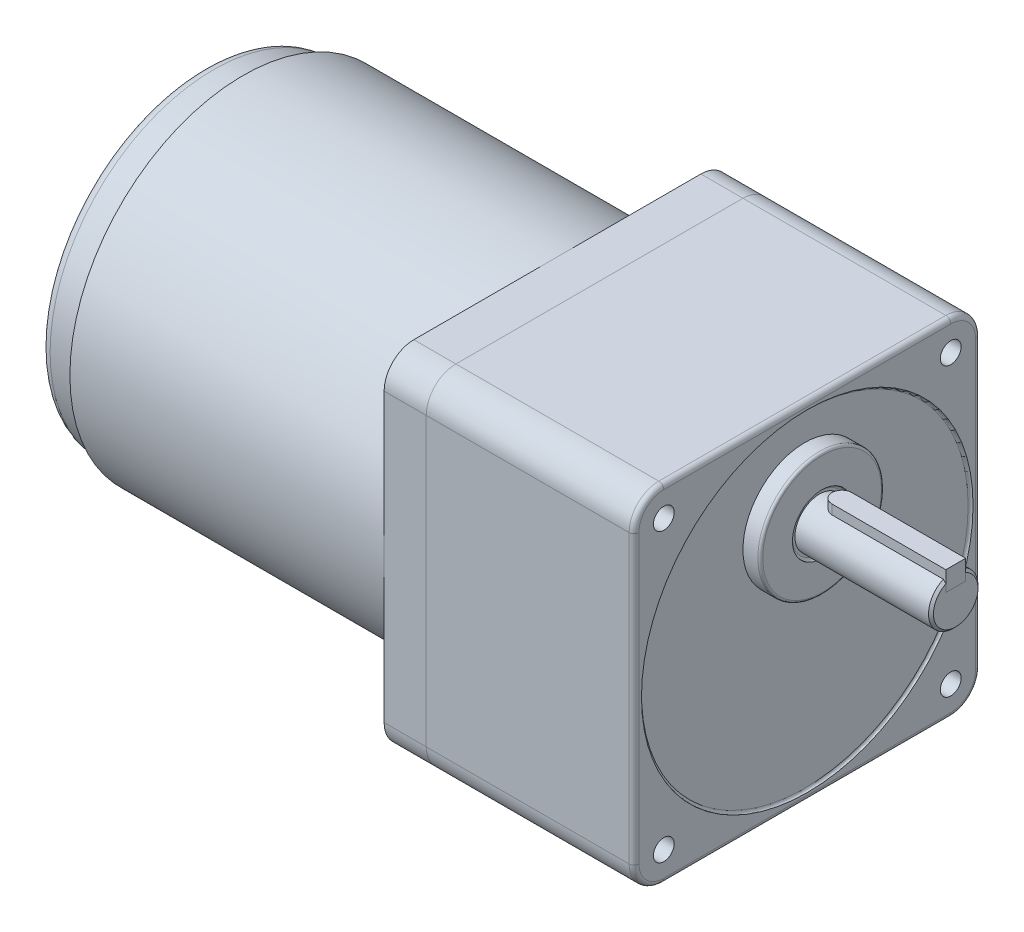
ISO-10303-21;
HEADER;
FILE_DESCRIPTION(('STEP AP214'),'2;1');
FILE_NAME('part.step','',(''),(''),'','','');
FILE_SCHEMA(('AUTOMOTIVE_DESIGN { 1 0 10303 214 1 1 1 1 }'));
ENDSEC;
DATA;
#1=APPLICATION_CONTEXT('core data for automotive mechanical design processes');
#2=APPLICATION_PROTOCOL_DEFINITION('international standard','automotive_design',2000,#1);
#3=PRODUCT_CONTEXT('',#1,'mechanical');
#4=PRODUCT('Part','Part','',(#3));
#5=PRODUCT_RELATED_PRODUCT_CATEGORY('part','',(#4));
#6=PRODUCT_DEFINITION_FORMATION('','',#4);
#7=PRODUCT_DEFINITION_CONTEXT('part definition',#1,'design');
#8=PRODUCT_DEFINITION('design','',#6,#7);
#9=PRODUCT_DEFINITION_SHAPE('','',#8);
#10=(LENGTH_UNIT() NAMED_UNIT(*) SI_UNIT(.MILLI.,.METRE.));
#11=(NAMED_UNIT(*) PLANE_ANGLE_UNIT() SI_UNIT($,.RADIAN.));
#12=(NAMED_UNIT(*) SI_UNIT($,.STERADIAN.) SOLID_ANGLE_UNIT());
#13=UNCERTAINTY_MEASURE_WITH_UNIT(LENGTH_MEASURE(1.E-05),#10,'distance_accuracy_value','');
#14=(GEOMETRIC_REPRESENTATION_CONTEXT(3) GLOBAL_UNCERTAINTY_ASSIGNED_CONTEXT((#13)) GLOBAL_UNIT_ASSIGNED_CONTEXT((#10,
#11,#12)) REPRESENTATION_CONTEXT('',''));
#15=CARTESIAN_POINT('',(0.,0.,0.));
#16=DIRECTION('',(0.,0.,1.));
#17=DIRECTION('',(1.,0.,0.));
#18=AXIS2_PLACEMENT_3D('',#15,#16,#17);
#19=CARTESIAN_POINT('',(7.,21.5,0.));
#20=DIRECTION('',(0.,-1.,0.));
#21=DIRECTION('',(0.,0.,-1.));
#22=AXIS2_PLACEMENT_3D('',#19,#20,#21);
#23=CYLINDRICAL_SURFACE('',#22,2.);
#24=CARTESIAN_POINT('',(7.,17.5,0.));
#25=DIRECTION('',(0.,1.,0.));
#26=DIRECTION('',(0.,0.,1.));
#27=AXIS2_PLACEMENT_3D('',#24,#25,#26);
#28=CIRCLE('',#27,2.);
#29=CARTESIAN_POINT('',(7.,17.5,-2.));
#30=VERTEX_POINT('',#29);
#31=CARTESIAN_POINT('',(7.,17.5,2.));
#32=VERTEX_POINT('',#31);
#33=EDGE_CURVE('E111',#30,#32,#28,.T.);
#34=ORIENTED_EDGE('',*,*,#33,.T.);
#35=DIRECTION('',(0.,-1.,0.));
#36=VECTOR('',#35,1.);
#37=CARTESIAN_POINT('',(7.,21.5,2.));
#38=LINE('',#37,#36);
#39=CARTESIAN_POINT('',(7.,21.5,2.));
#40=VERTEX_POINT('',#39);
#41=EDGE_CURVE('E12',#40,#32,#38,.T.);
#42=ORIENTED_EDGE('',*,*,#41,.F.);
#43=CARTESIAN_POINT('',(7.,21.5,0.));
#44=DIRECTION('',(0.,1.,0.));
#45=DIRECTION('',(0.,0.,1.));
#46=AXIS2_PLACEMENT_3D('',#43,#44,#45);
#47=CIRCLE('',#46,2.);
#48=CARTESIAN_POINT('',(7.,21.5,-2.));
#49=VERTEX_POINT('',#48);
#50=EDGE_CURVE('E99',#49,#40,#47,.T.);
#51=ORIENTED_EDGE('',*,*,#50,.F.);
#52=DIRECTION('',(0.,-1.,0.));
#53=VECTOR('',#52,1.);
#54=CARTESIAN_POINT('',(7.,21.5,-2.));
#55=LINE('',#54,#53);
#56=EDGE_CURVE('E107',#49,#30,#55,.T.);
#57=ORIENTED_EDGE('',*,*,#56,.T.);
#58=EDGE_LOOP('',(#34,#42,#51,#57));
#59=FACE_BOUND('',#58,.T.);
#60=ADVANCED_FACE('F48',(#59),#23,.T.);
#61=CARTESIAN_POINT('',(30.,21.5,2.));
#62=DIRECTION('',(0.,0.,-1.));
#63=DIRECTION('',(-1.,0.,0.));
#64=AXIS2_PLACEMENT_3D('',#61,#62,#63);
#65=PLANE('',#64);
#66=DIRECTION('',(1.,0.,0.));
#67=VECTOR('',#66,1.);
#68=CARTESIAN_POINT('',(30.,17.5,2.));
#69=LINE('',#68,#67);
#70=CARTESIAN_POINT('',(30.,17.5,2.));
#71=VERTEX_POINT('',#70);
#72=EDGE_CURVE('E103',#32,#71,#69,.T.);
#73=ORIENTED_EDGE('',*,*,#72,.T.);
#74=DIRECTION('',(0.,-1.,0.));
#75=VECTOR('',#74,1.);
#76=CARTESIAN_POINT('',(30.,21.5,2.));
#77=LINE('',#76,#75);
#78=CARTESIAN_POINT('',(30.,21.5,2.));
#79=VERTEX_POINT('',#78);
#80=EDGE_CURVE('E56',#79,#71,#77,.T.);
#81=ORIENTED_EDGE('',*,*,#80,.F.);
#82=DIRECTION('',(1.,0.,0.));
#83=VECTOR('',#82,1.);
#84=CARTESIAN_POINT('',(30.,21.5,2.));
#85=LINE('',#84,#83);
#86=EDGE_CURVE('E94',#40,#79,#85,.T.);
#87=ORIENTED_EDGE('',*,*,#86,.F.);
#88=ORIENTED_EDGE('',*,*,#41,.T.);
#89=EDGE_LOOP('',(#73,#81,#87,#88));
#90=FACE_BOUND('',#89,.T.);
#91=ADVANCED_FACE('F102',(#90),#65,.F.);
#92=CARTESIAN_POINT('',(30.,21.5,-2.));
#93=DIRECTION('',(-1.,0.,0.));
#94=DIRECTION('',(0.,0.,1.));
#95=AXIS2_PLACEMENT_3D('',#92,#93,#94);
#96=PLANE('',#95);
#97=DIRECTION('',(0.,0.,-1.));
#98=VECTOR('',#97,1.);
#99=CARTESIAN_POINT('',(30.,17.5,-2.));
#100=LINE('',#99,#98);
#101=CARTESIAN_POINT('',(30.,17.5,-2.));
#102=VERTEX_POINT('',#101);
#103=EDGE_CURVE('E81',#71,#102,#100,.T.);
#104=ORIENTED_EDGE('',*,*,#103,.T.);
#105=DIRECTION('',(0.,-1.,0.));
#106=VECTOR('',#105,1.);
#107=CARTESIAN_POINT('',(30.,21.5,-2.));
#108=LINE('',#107,#106);
#109=CARTESIAN_POINT('',(30.,21.5,-2.));
#110=VERTEX_POINT('',#109);
#111=EDGE_CURVE('E104',#110,#102,#108,.T.);
#112=ORIENTED_EDGE('',*,*,#111,.F.);
#113=DIRECTION('',(0.,0.,-1.));
#114=VECTOR('',#113,1.);
#115=CARTESIAN_POINT('',(30.,21.5,-2.));
#116=LINE('',#115,#114);
#117=EDGE_CURVE('E97',#79,#110,#116,.T.);
#118=ORIENTED_EDGE('',*,*,#117,.F.);
#119=ORIENTED_EDGE('',*,*,#80,.T.);
#120=EDGE_LOOP('',(#104,#112,#118,#119));
#121=FACE_BOUND('',#120,.T.);
#122=ADVANCED_FACE('F105',(#121),#96,.F.);
#123=CARTESIAN_POINT('',(7.,21.5,-2.));
#124=DIRECTION('',(0.,0.,1.));
#125=DIRECTION('',(1.,0.,0.));
#126=AXIS2_PLACEMENT_3D('',#123,#124,#125);
#127=PLANE('',#126);
#128=DIRECTION('',(-1.,0.,0.));
#129=VECTOR('',#128,1.);
#130=CARTESIAN_POINT('',(7.,17.5,-2.));
#131=LINE('',#130,#129);
#132=EDGE_CURVE('E87',#102,#30,#131,.T.);
#133=ORIENTED_EDGE('',*,*,#132,.T.);
#134=ORIENTED_EDGE('',*,*,#56,.F.);
#135=DIRECTION('',(-1.,0.,0.));
#136=VECTOR('',#135,1.);
#137=CARTESIAN_POINT('',(7.,21.5,-2.));
#138=LINE('',#137,#136);
#139=EDGE_CURVE('E64',#110,#49,#138,.T.);
#140=ORIENTED_EDGE('',*,*,#139,.F.);
#141=ORIENTED_EDGE('',*,*,#111,.T.);
#142=EDGE_LOOP('',(#133,#134,#140,#141));
#143=FACE_BOUND('',#142,.T.);
#144=ADVANCED_FACE('F118',(#143),#127,.F.);
#145=CARTESIAN_POINT('',(7.,21.5,0.));
#146=DIRECTION('',(0.,1.,0.));
#147=DIRECTION('',(0.,0.,1.));
#148=AXIS2_PLACEMENT_3D('',#145,#146,#147);
#149=PLANE('',#148);
#150=ORIENTED_EDGE('',*,*,#50,.T.);
#151=ORIENTED_EDGE('',*,*,#86,.T.);
#152=ORIENTED_EDGE('',*,*,#117,.T.);
#153=ORIENTED_EDGE('',*,*,#139,.T.);
#154=EDGE_LOOP('',(#150,#151,#152,#153));
#155=FACE_BOUND('',#154,.T.);
#156=ADVANCED_FACE('F95',(#155),#149,.T.);
#157=CARTESIAN_POINT('',(7.,17.5,0.));
#158=DIRECTION('',(0.,1.,0.));
#159=DIRECTION('',(0.,0.,1.));
#160=AXIS2_PLACEMENT_3D('',#157,#158,#159);
#161=PLANE('',#160);
#162=ORIENTED_EDGE('',*,*,#33,.F.);
#163=ORIENTED_EDGE('',*,*,#132,.F.);
#164=ORIENTED_EDGE('',*,*,#103,.F.);
#165=ORIENTED_EDGE('',*,*,#72,.F.);
#166=EDGE_LOOP('',(#162,#163,#164,#165));
#167=FACE_BOUND('',#166,.T.);
#168=ADVANCED_FACE('F121',(#167),#161,.F.);
#169=CLOSED_SHELL('',(#60,#91,#122,#144,#156,#168));
#170=MANIFOLD_SOLID_BREP('B2',#169);
#171=CARTESIAN_POINT('',(-114.,0.,0.));
#172=DIRECTION('',(-1.,0.,0.));
#173=DIRECTION('',(0.,0.,1.));
#174=AXIS2_PLACEMENT_3D('',#171,#172,#173);
#175=PLANE('',#174);
#176=CARTESIAN_POINT('',(-114.,0.,0.));
#177=DIRECTION('',(-1.,0.,0.));
#178=DIRECTION('',(0.,0.,1.));
#179=AXIS2_PLACEMENT_3D('',#176,#177,#178);
#180=CIRCLE('',#179,35.);
#181=CARTESIAN_POINT('',(-114.,0.,35.));
#182=VERTEX_POINT('',#181);
#183=EDGE_CURVE('E282',#182,#182,#180,.T.);
#184=ORIENTED_EDGE('',*,*,#183,.T.);
#185=EDGE_LOOP('',(#184));
#186=FACE_BOUND('',#185,.T.);
#187=CARTESIAN_POINT('',(-114.,0.,0.));
#188=DIRECTION('',(-1.,0.,0.));
#189=DIRECTION('',(0.,0.,1.));
#190=AXIS2_PLACEMENT_3D('',#187,#188,#189);
#191=CIRCLE('',#190,33.);
#192=CARTESIAN_POINT('',(-114.,0.,33.));
#193=VERTEX_POINT('',#192);
#194=EDGE_CURVE('E283',#193,#193,#191,.T.);
#195=ORIENTED_EDGE('',*,*,#194,.F.);
#196=EDGE_LOOP('',(#195));
#197=FACE_BOUND('',#196,.T.);
#198=ADVANCED_FACE('F181',(#186,#197),#175,.T.);
#199=CARTESIAN_POINT('',(-50.5,29.,29.));
#200=DIRECTION('',(1.,0.,0.));
#201=DIRECTION('',(0.,0.,-1.));
#202=AXIS2_PLACEMENT_3D('',#199,#200,#201);
#203=PLANE('',#202);
#204=CARTESIAN_POINT('',(-50.5,0.,0.));
#205=DIRECTION('',(-1.,0.,0.));
#206=DIRECTION('',(0.,0.,1.));
#207=AXIS2_PLACEMENT_3D('',#204,#205,#206);
#208=CIRCLE('',#207,35.);
#209=CARTESIAN_POINT('',(-50.5,0.,35.));
#210=VERTEX_POINT('',#209);
#211=CARTESIAN_POINT('',(-50.5,35.,0.));
#212=VERTEX_POINT('',#211);
#213=EDGE_CURVE('E277',#210,#212,#208,.T.);
#214=ORIENTED_EDGE('',*,*,#213,.F.);
#215=DIRECTION('',(0.,1.,0.));
#216=VECTOR('',#215,1.);
#217=CARTESIAN_POINT('',(-50.5,-28.9999999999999,35.));
#218=LINE('',#217,#216);
#219=CARTESIAN_POINT('',(-50.5,28.9999999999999,35.));
#220=VERTEX_POINT('',#219);
#221=EDGE_CURVE('E266',#210,#220,#218,.T.);
#222=ORIENTED_EDGE('',*,*,#221,.T.);
#223=CARTESIAN_POINT('',(-50.5,29.,29.));
#224=DIRECTION('',(-1.,0.,0.));
#225=DIRECTION('',(0.,0.,-1.));
#226=AXIS2_PLACEMENT_3D('',#223,#224,#225);
#227=CIRCLE('',#226,6.);
#228=CARTESIAN_POINT('',(-50.5,35.,29.));
#229=VERTEX_POINT('',#228);
#230=EDGE_CURVE('E294',#220,#229,#227,.T.);
#231=ORIENTED_EDGE('',*,*,#230,.T.);
#232=DIRECTION('',(0.,0.,-1.));
#233=VECTOR('',#232,1.);
#234=CARTESIAN_POINT('',(-50.5,35.,-29.));
#235=LINE('',#234,#233);
#236=EDGE_CURVE('E279',#229,#212,#235,.T.);
#237=ORIENTED_EDGE('',*,*,#236,.T.);
#238=EDGE_LOOP('',(#214,#222,#231,#237));
#239=FACE_BOUND('',#238,.T.);
#240=ADVANCED_FACE('F278',(#239),#203,.F.);
#241=CARTESIAN_POINT('',(-50.5,0.,-35.));
#242=VERTEX_POINT('',#241);
#243=EDGE_CURVE('E285',#212,#242,#208,.T.);
#244=ORIENTED_EDGE('',*,*,#243,.F.);
#245=CARTESIAN_POINT('',(-50.5,35.,-29.));
#246=VERTEX_POINT('',#245);
#247=EDGE_CURVE('E296',#212,#246,#235,.T.);
#248=ORIENTED_EDGE('',*,*,#247,.T.);
#249=CARTESIAN_POINT('',(-50.5,29.,-29.));
#250=DIRECTION('',(-1.,0.,0.));
#251=DIRECTION('',(0.,0.,-1.));
#252=AXIS2_PLACEMENT_3D('',#249,#250,#251);
#253=CIRCLE('',#252,6.);
#254=CARTESIAN_POINT('',(-50.5,29.,-35.));
#255=VERTEX_POINT('',#254);
#256=EDGE_CURVE('E299',#246,#255,#253,.T.);
#257=ORIENTED_EDGE('',*,*,#256,.T.);
#258=DIRECTION('',(0.,-1.,0.));
#259=VECTOR('',#258,1.);
#260=CARTESIAN_POINT('',(-50.5,-28.9999999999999,-35.));
#261=LINE('',#260,#259);
#262=EDGE_CURVE('E302',#255,#242,#261,.T.);
#263=ORIENTED_EDGE('',*,*,#262,.T.);
#264=EDGE_LOOP('',(#244,#248,#257,#263));
#265=FACE_BOUND('',#264,.T.);
#266=ADVANCED_FACE('F348',(#265),#203,.F.);
#267=CARTESIAN_POINT('',(-50.5,-35.,0.));
#268=VERTEX_POINT('',#267);
#269=EDGE_CURVE('E204',#242,#268,#208,.T.);
#270=ORIENTED_EDGE('',*,*,#269,.F.);
#271=CARTESIAN_POINT('',(-50.5,-28.9999999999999,-35.));
#272=VERTEX_POINT('',#271);
#273=EDGE_CURVE('E301',#242,#272,#261,.T.);
#274=ORIENTED_EDGE('',*,*,#273,.T.);
#275=CARTESIAN_POINT('',(-50.5,-29.,-29.));
#276=DIRECTION('',(-1.,0.,0.));
#277=DIRECTION('',(0.,0.,-1.));
#278=AXIS2_PLACEMENT_3D('',#275,#276,#277);
#279=CIRCLE('',#278,6.);
#280=CARTESIAN_POINT('',(-50.5,-35.,-29.));
#281=VERTEX_POINT('',#280);
#282=EDGE_CURVE('E305',#272,#281,#279,.T.);
#283=ORIENTED_EDGE('',*,*,#282,.T.);
#284=DIRECTION('',(0.,0.,1.));
#285=VECTOR('',#284,1.);
#286=CARTESIAN_POINT('',(-50.5,-35.,-29.));
#287=LINE('',#286,#285);
#288=EDGE_CURVE('E308',#281,#268,#287,.T.);
#289=ORIENTED_EDGE('',*,*,#288,.T.);
#290=EDGE_LOOP('',(#270,#274,#283,#289));
#291=FACE_BOUND('',#290,.T.);
#292=ADVANCED_FACE('F363',(#291),#203,.F.);
#293=EDGE_CURVE('E196',#268,#210,#208,.T.);
#294=ORIENTED_EDGE('',*,*,#293,.F.);
#295=CARTESIAN_POINT('',(-50.5,-35.,29.));
#296=VERTEX_POINT('',#295);
#297=EDGE_CURVE('E307',#268,#296,#287,.T.);
#298=ORIENTED_EDGE('',*,*,#297,.T.);
#299=CARTESIAN_POINT('',(-50.5,-29.,29.));
#300=DIRECTION('',(-1.,0.,0.));
#301=DIRECTION('',(0.,0.,1.));
#302=AXIS2_PLACEMENT_3D('',#299,#300,#301);
#303=CIRCLE('',#302,6.);
#304=CARTESIAN_POINT('',(-50.5,-29.,35.));
#305=VERTEX_POINT('',#304);
#306=EDGE_CURVE('E261',#296,#305,#303,.T.);
#307=ORIENTED_EDGE('',*,*,#306,.T.);
#308=EDGE_CURVE('E257',#305,#210,#218,.T.);
#309=ORIENTED_EDGE('',*,*,#308,.T.);
#310=EDGE_LOOP('',(#294,#298,#307,#309));
#311=FACE_BOUND('',#310,.T.);
#312=ADVANCED_FACE('F259',(#311),#203,.F.);
#313=CARTESIAN_POINT('',(-50.5,29.,29.));
#314=DIRECTION('',(1.,0.,0.));
#315=DIRECTION('',(0.,0.,-1.));
#316=AXIS2_PLACEMENT_3D('',#313,#314,#315);
#317=CYLINDRICAL_SURFACE('',#316,6.);
#318=CARTESIAN_POINT('',(-42.,29.,29.));
#319=DIRECTION('',(-1.,0.,0.));
#320=DIRECTION('',(0.,0.,-1.));
#321=AXIS2_PLACEMENT_3D('',#318,#319,#320);
#322=CIRCLE('',#321,6.);
#323=CARTESIAN_POINT('',(-42.,28.9999999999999,35.));
#324=VERTEX_POINT('',#323);
#325=CARTESIAN_POINT('',(-42.,35.,29.));
#326=VERTEX_POINT('',#325);
#327=EDGE_CURVE('E311',#324,#326,#322,.T.);
#328=ORIENTED_EDGE('',*,*,#327,.T.);
#329=DIRECTION('',(1.,0.,0.));
#330=VECTOR('',#329,1.);
#331=CARTESIAN_POINT('',(-50.5,35.,29.));
#332=LINE('',#331,#330);
#333=EDGE_CURVE('E287',#229,#326,#332,.T.);
#334=ORIENTED_EDGE('',*,*,#333,.F.);
#335=ORIENTED_EDGE('',*,*,#230,.F.);
#336=DIRECTION('',(1.,0.,0.));
#337=VECTOR('',#336,1.);
#338=CARTESIAN_POINT('',(-50.5,28.9999999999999,35.));
#339=LINE('',#338,#337);
#340=EDGE_CURVE('E265',#220,#324,#339,.T.);
#341=ORIENTED_EDGE('',*,*,#340,.T.);
#342=EDGE_LOOP('',(#328,#334,#335,#341));
#343=FACE_BOUND('',#342,.T.);
#344=ADVANCED_FACE('F382',(#343),#317,.T.);
#345=CARTESIAN_POINT('',(-50.5,35.,-29.));
#346=DIRECTION('',(0.,-1.,0.));
#347=DIRECTION('',(0.,0.,-1.));
#348=AXIS2_PLACEMENT_3D('',#345,#346,#347);
#349=PLANE('',#348);
#350=DIRECTION('',(0.,0.,-1.));
#351=VECTOR('',#350,1.);
#352=CARTESIAN_POINT('',(-42.,35.,-29.));
#353=LINE('',#352,#351);
#354=CARTESIAN_POINT('',(-42.,35.,-29.));
#355=VERTEX_POINT('',#354);
#356=EDGE_CURVE('E314',#326,#355,#353,.T.);
#357=ORIENTED_EDGE('',*,*,#356,.T.);
#358=DIRECTION('',(1.,0.,0.));
#359=VECTOR('',#358,1.);
#360=CARTESIAN_POINT('',(-50.5,35.,-29.));
#361=LINE('',#360,#359);
#362=EDGE_CURVE('E289',#246,#355,#361,.T.);
#363=ORIENTED_EDGE('',*,*,#362,.F.);
#364=ORIENTED_EDGE('',*,*,#247,.F.);
#365=ORIENTED_EDGE('',*,*,#236,.F.);
#366=ORIENTED_EDGE('',*,*,#333,.T.);
#367=EDGE_LOOP('',(#357,#363,#364,#365,#366));
#368=FACE_BOUND('',#367,.T.);
#369=ADVANCED_FACE('F352',(#368),#349,.F.);
#370=CARTESIAN_POINT('',(-50.5,29.,-29.));
#371=DIRECTION('',(1.,0.,0.));
#372=DIRECTION('',(0.,0.,-1.));
#373=AXIS2_PLACEMENT_3D('',#370,#371,#372);
#374=CYLINDRICAL_SURFACE('',#373,6.);
#375=CARTESIAN_POINT('',(-42.,29.,-29.));
#376=DIRECTION('',(-1.,0.,0.));
#377=DIRECTION('',(0.,0.,-1.));
#378=AXIS2_PLACEMENT_3D('',#375,#376,#377);
#379=CIRCLE('',#378,6.);
#380=CARTESIAN_POINT('',(-42.,29.,-35.));
#381=VERTEX_POINT('',#380);
#382=EDGE_CURVE('E316',#355,#381,#379,.T.);
#383=ORIENTED_EDGE('',*,*,#382,.T.);
#384=DIRECTION('',(1.,0.,0.));
#385=VECTOR('',#384,1.);
#386=CARTESIAN_POINT('',(-50.5,29.,-35.));
#387=LINE('',#386,#385);
#388=EDGE_CURVE('E339',#255,#381,#387,.T.);
#389=ORIENTED_EDGE('',*,*,#388,.F.);
#390=ORIENTED_EDGE('',*,*,#256,.F.);
#391=ORIENTED_EDGE('',*,*,#362,.T.);
#392=EDGE_LOOP('',(#383,#389,#390,#391));
#393=FACE_BOUND('',#392,.T.);
#394=ADVANCED_FACE('F357',(#393),#374,.T.);
#395=CARTESIAN_POINT('',(-50.5,-28.9999999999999,-35.));
#396=DIRECTION('',(0.,0.,1.));
#397=DIRECTION('',(1.,0.,0.));
#398=AXIS2_PLACEMENT_3D('',#395,#396,#397);
#399=PLANE('',#398);
#400=DIRECTION('',(0.,-1.,0.));
#401=VECTOR('',#400,1.);
#402=CARTESIAN_POINT('',(-42.,-28.9999999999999,-35.));
#403=LINE('',#402,#401);
#404=CARTESIAN_POINT('',(-42.,-28.9999999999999,-35.));
#405=VERTEX_POINT('',#404);
#406=EDGE_CURVE('E318',#381,#405,#403,.T.);
#407=ORIENTED_EDGE('',*,*,#406,.T.);
#408=DIRECTION('',(1.,0.,0.));
#409=VECTOR('',#408,1.);
#410=CARTESIAN_POINT('',(-50.5,-28.9999999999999,-35.));
#411=LINE('',#410,#409);
#412=EDGE_CURVE('E336',#272,#405,#411,.T.);
#413=ORIENTED_EDGE('',*,*,#412,.F.);
#414=ORIENTED_EDGE('',*,*,#273,.F.);
#415=ORIENTED_EDGE('',*,*,#262,.F.);
#416=ORIENTED_EDGE('',*,*,#388,.T.);
#417=EDGE_LOOP('',(#407,#413,#414,#415,#416));
#418=FACE_BOUND('',#417,.T.);
#419=ADVANCED_FACE('F360',(#418),#399,.F.);
#420=CARTESIAN_POINT('',(-50.5,-29.,-29.));
#421=DIRECTION('',(1.,0.,0.));
#422=DIRECTION('',(0.,0.,-1.));
#423=AXIS2_PLACEMENT_3D('',#420,#421,#422);
#424=CYLINDRICAL_SURFACE('',#423,6.);
#425=CARTESIAN_POINT('',(-42.,-29.,-29.));
#426=DIRECTION('',(-1.,0.,0.));
#427=DIRECTION('',(0.,0.,-1.));
#428=AXIS2_PLACEMENT_3D('',#425,#426,#427);
#429=CIRCLE('',#428,6.);
#430=CARTESIAN_POINT('',(-42.,-35.,-29.));
#431=VERTEX_POINT('',#430);
#432=EDGE_CURVE('E320',#405,#431,#429,.T.);
#433=ORIENTED_EDGE('',*,*,#432,.T.);
#434=DIRECTION('',(1.,0.,0.));
#435=VECTOR('',#434,1.);
#436=CARTESIAN_POINT('',(-50.5,-35.,-29.));
#437=LINE('',#436,#435);
#438=EDGE_CURVE('E333',#281,#431,#437,.T.);
#439=ORIENTED_EDGE('',*,*,#438,.F.);
#440=ORIENTED_EDGE('',*,*,#282,.F.);
#441=ORIENTED_EDGE('',*,*,#412,.T.);
#442=EDGE_LOOP('',(#433,#439,#440,#441));
#443=FACE_BOUND('',#442,.T.);
#444=ADVANCED_FACE('F367',(#443),#424,.T.);
#445=CARTESIAN_POINT('',(-50.5,-35.,-29.));
#446=DIRECTION('',(0.,1.,0.));
#447=DIRECTION('',(0.,0.,1.));
#448=AXIS2_PLACEMENT_3D('',#445,#446,#447);
#449=PLANE('',#448);
#450=DIRECTION('',(0.,0.,1.));
#451=VECTOR('',#450,1.);
#452=CARTESIAN_POINT('',(-42.,-35.,-29.));
#453=LINE('',#452,#451);
#454=CARTESIAN_POINT('',(-42.,-35.,29.));
#455=VERTEX_POINT('',#454);
#456=EDGE_CURVE('E322',#431,#455,#453,.T.);
#457=ORIENTED_EDGE('',*,*,#456,.T.);
#458=DIRECTION('',(1.,0.,0.));
#459=VECTOR('',#458,1.);
#460=CARTESIAN_POINT('',(-50.5,-35.,29.));
#461=LINE('',#460,#459);
#462=EDGE_CURVE('E330',#296,#455,#461,.T.);
#463=ORIENTED_EDGE('',*,*,#462,.F.);
#464=ORIENTED_EDGE('',*,*,#297,.F.);
#465=ORIENTED_EDGE('',*,*,#288,.F.);
#466=ORIENTED_EDGE('',*,*,#438,.T.);
#467=EDGE_LOOP('',(#457,#463,#464,#465,#466));
#468=FACE_BOUND('',#467,.T.);
#469=ADVANCED_FACE('F371',(#468),#449,.F.);
#470=CARTESIAN_POINT('',(-50.5,-29.,29.));
#471=DIRECTION('',(1.,0.,0.));
#472=DIRECTION('',(0.,0.,-1.));
#473=AXIS2_PLACEMENT_3D('',#470,#471,#472);
#474=CYLINDRICAL_SURFACE('',#473,6.);
#475=CARTESIAN_POINT('',(-42.,-29.,29.));
#476=DIRECTION('',(-1.,0.,0.));
#477=DIRECTION('',(0.,0.,1.));
#478=AXIS2_PLACEMENT_3D('',#475,#476,#477);
#479=CIRCLE('',#478,6.);
#480=CARTESIAN_POINT('',(-42.,-29.,35.));
#481=VERTEX_POINT('',#480);
#482=EDGE_CURVE('E324',#455,#481,#479,.T.);
#483=ORIENTED_EDGE('',*,*,#482,.T.);
#484=DIRECTION('',(1.,0.,0.));
#485=VECTOR('',#484,1.);
#486=CARTESIAN_POINT('',(-50.5,-29.,35.));
#487=LINE('',#486,#485);
#488=EDGE_CURVE('E328',#305,#481,#487,.T.);
#489=ORIENTED_EDGE('',*,*,#488,.F.);
#490=ORIENTED_EDGE('',*,*,#306,.F.);
#491=ORIENTED_EDGE('',*,*,#462,.T.);
#492=EDGE_LOOP('',(#483,#489,#490,#491));
#493=FACE_BOUND('',#492,.T.);
#494=ADVANCED_FACE('F375',(#493),#474,.T.);
#495=CARTESIAN_POINT('',(-50.5,-28.9999999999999,35.));
#496=DIRECTION('',(0.,0.,-1.));
#497=DIRECTION('',(-1.,0.,0.));
#498=AXIS2_PLACEMENT_3D('',#495,#496,#497);
#499=PLANE('',#498);
#500=DIRECTION('',(0.,1.,0.));
#501=VECTOR('',#500,1.);
#502=CARTESIAN_POINT('',(-42.,-28.9999999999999,35.));
#503=LINE('',#502,#501);
#504=EDGE_CURVE('E297',#481,#324,#503,.T.);
#505=ORIENTED_EDGE('',*,*,#504,.T.);
#506=ORIENTED_EDGE('',*,*,#340,.F.);
#507=ORIENTED_EDGE('',*,*,#221,.F.);
#508=ORIENTED_EDGE('',*,*,#308,.F.);
#509=ORIENTED_EDGE('',*,*,#488,.T.);
#510=EDGE_LOOP('',(#505,#506,#507,#508,#509));
#511=FACE_BOUND('',#510,.T.);
#512=ADVANCED_FACE('F270',(#511),#499,.F.);
#513=CARTESIAN_POINT('',(-42.,29.,29.));
#514=DIRECTION('',(1.,0.,0.));
#515=DIRECTION('',(0.,0.,-1.));
#516=AXIS2_PLACEMENT_3D('',#513,#514,#515);
#517=PLANE('',#516);
#518=ORIENTED_EDGE('',*,*,#327,.F.);
#519=ORIENTED_EDGE('',*,*,#504,.F.);
#520=ORIENTED_EDGE('',*,*,#482,.F.);
#521=ORIENTED_EDGE('',*,*,#456,.F.);
#522=ORIENTED_EDGE('',*,*,#432,.F.);
#523=ORIENTED_EDGE('',*,*,#406,.F.);
#524=ORIENTED_EDGE('',*,*,#382,.F.);
#525=ORIENTED_EDGE('',*,*,#356,.F.);
#526=EDGE_LOOP('',(#518,#519,#520,#521,#522,#523,#524,#525));
#527=FACE_BOUND('',#526,.T.);
#528=ADVANCED_FACE('F379',(#527),#517,.T.);
#529=CARTESIAN_POINT('',(-114.,0.,0.));
#530=DIRECTION('',(1.,0.,0.));
#531=DIRECTION('',(0.,0.,-1.));
#532=AXIS2_PLACEMENT_3D('',#529,#530,#531);
#533=CYLINDRICAL_SURFACE('',#532,35.);
#534=ORIENTED_EDGE('',*,*,#183,.F.);
#535=EDGE_LOOP('',(#534));
#536=FACE_BOUND('',#535,.T.);
#537=ORIENTED_EDGE('',*,*,#213,.T.);
#538=ORIENTED_EDGE('',*,*,#243,.T.);
#539=ORIENTED_EDGE('',*,*,#269,.T.);
#540=ORIENTED_EDGE('',*,*,#293,.T.);
#541=EDGE_LOOP('',(#537,#538,#539,#540));
#542=FACE_BOUND('',#541,.T.);
#543=ADVANCED_FACE('F286',(#536,#542),#533,.T.);
#544=CARTESIAN_POINT('',(-122.,0.,0.));
#545=DIRECTION('',(1.,0.,0.));
#546=DIRECTION('',(0.,0.,-1.));
#547=AXIS2_PLACEMENT_3D('',#544,#545,#546);
#548=CYLINDRICAL_SURFACE('',#547,33.);
#549=CARTESIAN_POINT('',(-120.,0.,0.));
#550=DIRECTION('',(-1.,0.,0.));
#551=DIRECTION('',(0.,0.,1.));
#552=AXIS2_PLACEMENT_3D('',#549,#550,#551);
#553=CIRCLE('',#552,33.);
#554=CARTESIAN_POINT('',(-120.,0.,33.));
#555=VERTEX_POINT('',#554);
#556=EDGE_CURVE('E46',#555,#555,#553,.F.);
#557=ORIENTED_EDGE('',*,*,#556,.T.);
#558=EDGE_LOOP('',(#557));
#559=FACE_BOUND('',#558,.T.);
#560=ORIENTED_EDGE('',*,*,#194,.T.);
#561=EDGE_LOOP('',(#560));
#562=FACE_BOUND('',#561,.T.);
#563=ADVANCED_FACE('F400',(#559,#562),#548,.T.);
#564=CARTESIAN_POINT('',(-122.,0.,0.));
#565=DIRECTION('',(-1.,0.,0.));
#566=DIRECTION('',(0.,0.,1.));
#567=AXIS2_PLACEMENT_3D('',#564,#565,#566);
#568=PLANE('',#567);
#569=CARTESIAN_POINT('',(-122.,0.,0.));
#570=DIRECTION('',(-1.,0.,0.));
#571=DIRECTION('',(0.,0.,1.));
#572=AXIS2_PLACEMENT_3D('',#569,#570,#571);
#573=CIRCLE('',#572,31.);
#574=CARTESIAN_POINT('',(-122.,0.,31.));
#575=VERTEX_POINT('',#574);
#576=EDGE_CURVE('E189',#575,#575,#573,.T.);
#577=ORIENTED_EDGE('',*,*,#576,.T.);
#578=EDGE_LOOP('',(#577));
#579=FACE_BOUND('',#578,.T.);
#580=ADVANCED_FACE('F457',(#579),#568,.T.);
#581=CARTESIAN_POINT('',(-120.,0.,0.));
#582=DIRECTION('',(-1.,0.,0.));
#583=DIRECTION('',(0.,0.,1.));
#584=AXIS2_PLACEMENT_3D('',#581,#582,#583);
#585=TOROIDAL_SURFACE('',#584,31.,2.);
#586=ORIENTED_EDGE('',*,*,#556,.F.);
#587=EDGE_LOOP('',(#586));
#588=FACE_BOUND('',#587,.T.);
#589=ORIENTED_EDGE('',*,*,#576,.F.);
#590=EDGE_LOOP('',(#589));
#591=FACE_BOUND('',#590,.T.);
#592=ADVANCED_FACE('F183',(#588,#591),#585,.T.);
#593=CLOSED_SHELL('',(#198,#240,#266,#292,#312,#344,#369,#394,#419,#444,#469,#494,#512,#528,
#543,#563,#580,#592));
#594=MANIFOLD_SOLID_BREP('B6',#593);
#595=CARTESIAN_POINT('',(2.5,15.,0.));
#596=DIRECTION('',(1.,0.,0.));
#597=DIRECTION('',(0.,0.,-1.));
#598=AXIS2_PLACEMENT_3D('',#595,#596,#597);
#599=PLANE('',#598);
#600=CARTESIAN_POINT('',(2.5,15.,0.));
#601=DIRECTION('',(1.,0.,0.));
#602=DIRECTION('',(0.,0.,-1.));
#603=AXIS2_PLACEMENT_3D('',#600,#601,#602);
#604=CIRCLE('',#603,5.5);
#605=CARTESIAN_POINT('',(2.5,15.,-5.5));
#606=VERTEX_POINT('',#605);
#607=EDGE_CURVE('E859',#606,#606,#604,.T.);
#608=ORIENTED_EDGE('',*,*,#607,.T.);
#609=EDGE_LOOP('',(#608));
#610=FACE_BOUND('',#609,.T.);
#611=CARTESIAN_POINT('',(2.5,15.,0.));
#612=DIRECTION('',(1.,0.,0.));
#613=DIRECTION('',(0.,0.,-1.));
#614=AXIS2_PLACEMENT_3D('',#611,#612,#613);
#615=CIRCLE('',#614,5.);
#616=CARTESIAN_POINT('',(2.5,15.,-5.));
#617=VERTEX_POINT('',#616);
#618=EDGE_CURVE('E710',#617,#617,#615,.T.);
#619=ORIENTED_EDGE('',*,*,#618,.F.);
#620=EDGE_LOOP('',(#619));
#621=FACE_BOUND('',#620,.T.);
#622=ADVANCED_FACE('F539',(#610,#621),#599,.T.);
#623=CARTESIAN_POINT('',(-0.5,0.,0.));
#624=DIRECTION('',(1.,0.,0.));
#625=DIRECTION('',(0.,0.,-1.));
#626=AXIS2_PLACEMENT_3D('',#623,#624,#625);
#627=PLANE('',#626);
#628=CARTESIAN_POINT('',(-0.5,0.,0.));
#629=DIRECTION('',(1.,0.,0.));
#630=DIRECTION('',(0.,0.,-1.));
#631=AXIS2_PLACEMENT_3D('',#628,#629,#630);
#632=CIRCLE('',#631,33.);
#633=CARTESIAN_POINT('',(-0.5,0.,-33.));
#634=VERTEX_POINT('',#633);
#635=EDGE_CURVE('E830',#634,#634,#632,.T.);
#636=ORIENTED_EDGE('',*,*,#635,.T.);
#637=EDGE_LOOP('',(#636));
#638=FACE_BOUND('',#637,.T.);
#639=CARTESIAN_POINT('',(-0.5,15.,0.));
#640=DIRECTION('',(1.,0.,0.));
#641=DIRECTION('',(0.,0.,-1.));
#642=AXIS2_PLACEMENT_3D('',#639,#640,#641);
#643=CIRCLE('',#642,12.5);
#644=CARTESIAN_POINT('',(-0.5,15.,-12.5));
#645=VERTEX_POINT('',#644);
#646=EDGE_CURVE('E716',#645,#645,#643,.T.);
#647=ORIENTED_EDGE('',*,*,#646,.F.);
#648=EDGE_LOOP('',(#647));
#649=FACE_BOUND('',#648,.T.);
#650=ADVANCED_FACE('F887',(#638,#649),#627,.T.);
#651=CARTESIAN_POINT('',(0.,-29.,29.));
#652=DIRECTION('',(-1.,0.,0.));
#653=DIRECTION('',(0.,0.,1.));
#654=AXIS2_PLACEMENT_3D('',#651,#652,#653);
#655=PLANE('',#654);
#656=CARTESIAN_POINT('',(0.,0.,0.));
#657=DIRECTION('',(1.,0.,0.));
#658=DIRECTION('',(0.,0.,-1.));
#659=AXIS2_PLACEMENT_3D('',#656,#657,#658);
#660=CIRCLE('',#659,33.5);
#661=CARTESIAN_POINT('',(0.,0.,-33.5));
#662=VERTEX_POINT('',#661);
#663=EDGE_CURVE('E719',#662,#662,#660,.T.);
#664=ORIENTED_EDGE('',*,*,#663,.F.);
#665=EDGE_LOOP('',(#664));
#666=FACE_BOUND('',#665,.T.);
#667=CARTESIAN_POINT('',(0.,28.9913780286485,28.9913780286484));
#668=DIRECTION('',(1.,0.,0.));
#669=DIRECTION('',(0.,0.,-1.));
#670=AXIS2_PLACEMENT_3D('',#667,#668,#669);
#671=CIRCLE('',#670,2.1);
#672=CARTESIAN_POINT('',(0.,28.9913780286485,26.8913780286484));
#673=VERTEX_POINT('',#672);
#674=EDGE_CURVE('E722',#673,#673,#671,.T.);
#675=ORIENTED_EDGE('',*,*,#674,.F.);
#676=EDGE_LOOP('',(#675));
#677=FACE_BOUND('',#676,.T.);
#678=CARTESIAN_POINT('',(0.,28.9913780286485,-28.9913780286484));
#679=DIRECTION('',(1.,0.,0.));
#680=DIRECTION('',(0.,0.,-1.));
#681=AXIS2_PLACEMENT_3D('',#678,#679,#680);
#682=CIRCLE('',#681,2.1);
#683=CARTESIAN_POINT('',(0.,28.9913780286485,-31.0913780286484));
#684=VERTEX_POINT('',#683);
#685=EDGE_CURVE('E728',#684,#684,#682,.T.);
#686=ORIENTED_EDGE('',*,*,#685,.F.);
#687=EDGE_LOOP('',(#686));
#688=FACE_BOUND('',#687,.T.);
#689=CARTESIAN_POINT('',(0.,29.,29.));
#690=DIRECTION('',(-1.,0.,0.));
#691=DIRECTION('',(0.,0.,1.));
#692=AXIS2_PLACEMENT_3D('',#689,#690,#691);
#693=CIRCLE('',#692,5.);
#694=CARTESIAN_POINT('',(0.,34.,29.));
#695=VERTEX_POINT('',#694);
#696=CARTESIAN_POINT('',(0.,29.,34.));
#697=VERTEX_POINT('',#696);
#698=EDGE_CURVE('E808',#695,#697,#693,.F.);
#699=ORIENTED_EDGE('',*,*,#698,.T.);
#700=DIRECTION('',(0.,-1.,0.));
#701=VECTOR('',#700,1.);
#702=CARTESIAN_POINT('',(0.,-29.,34.));
#703=LINE('',#702,#701);
#704=CARTESIAN_POINT('',(0.,-29.,34.));
#705=VERTEX_POINT('',#704);
#706=EDGE_CURVE('E810',#697,#705,#703,.T.);
#707=ORIENTED_EDGE('',*,*,#706,.T.);
#708=CARTESIAN_POINT('',(0.,-29.,29.));
#709=DIRECTION('',(-1.,0.,0.));
#710=DIRECTION('',(0.,0.,1.));
#711=AXIS2_PLACEMENT_3D('',#708,#709,#710);
#712=CIRCLE('',#711,5.);
#713=CARTESIAN_POINT('',(0.,-34.,29.));
#714=VERTEX_POINT('',#713);
#715=EDGE_CURVE('E776',#705,#714,#712,.F.);
#716=ORIENTED_EDGE('',*,*,#715,.T.);
#717=DIRECTION('',(0.,0.,-1.));
#718=VECTOR('',#717,1.);
#719=CARTESIAN_POINT('',(0.,-34.,-29.));
#720=LINE('',#719,#718);
#721=CARTESIAN_POINT('',(0.,-34.,-29.));
#722=VERTEX_POINT('',#721);
#723=EDGE_CURVE('E798',#714,#722,#720,.T.);
#724=ORIENTED_EDGE('',*,*,#723,.T.);
#725=CARTESIAN_POINT('',(0.,-29.,-29.));
#726=DIRECTION('',(-1.,0.,0.));
#727=DIRECTION('',(0.,0.,1.));
#728=AXIS2_PLACEMENT_3D('',#725,#726,#727);
#729=CIRCLE('',#728,5.);
#730=CARTESIAN_POINT('',(0.,-29.,-34.));
#731=VERTEX_POINT('',#730);
#732=EDGE_CURVE('E800',#722,#731,#729,.F.);
#733=ORIENTED_EDGE('',*,*,#732,.T.);
#734=DIRECTION('',(0.,1.,0.));
#735=VECTOR('',#734,1.);
#736=CARTESIAN_POINT('',(0.,29.,-34.));
#737=LINE('',#736,#735);
#738=CARTESIAN_POINT('',(0.,29.,-34.));
#739=VERTEX_POINT('',#738);
#740=EDGE_CURVE('E802',#731,#739,#737,.T.);
#741=ORIENTED_EDGE('',*,*,#740,.T.);
#742=CARTESIAN_POINT('',(0.,29.,-29.));
#743=DIRECTION('',(-1.,0.,0.));
#744=DIRECTION('',(0.,0.,1.));
#745=AXIS2_PLACEMENT_3D('',#742,#743,#744);
#746=CIRCLE('',#745,5.);
#747=CARTESIAN_POINT('',(0.,34.,-29.));
#748=VERTEX_POINT('',#747);
#749=EDGE_CURVE('E804',#739,#748,#746,.F.);
#750=ORIENTED_EDGE('',*,*,#749,.T.);
#751=DIRECTION('',(0.,0.,1.));
#752=VECTOR('',#751,1.);
#753=CARTESIAN_POINT('',(0.,34.,29.));
#754=LINE('',#753,#752);
#755=EDGE_CURVE('E806',#748,#695,#754,.T.);
#756=ORIENTED_EDGE('',*,*,#755,.T.);
#757=EDGE_LOOP('',(#699,#707,#716,#724,#733,#741,#750,#756));
#758=FACE_BOUND('',#757,.T.);
#759=CARTESIAN_POINT('',(0.,-28.9913780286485,28.9913780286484));
#760=DIRECTION('',(1.,0.,0.));
#761=DIRECTION('',(0.,0.,-1.));
#762=AXIS2_PLACEMENT_3D('',#759,#760,#761);
#763=CIRCLE('',#762,2.1);
#764=CARTESIAN_POINT('',(0.,-28.9913780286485,26.8913780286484));
#765=VERTEX_POINT('',#764);
#766=EDGE_CURVE('E740',#765,#765,#763,.T.);
#767=ORIENTED_EDGE('',*,*,#766,.F.);
#768=EDGE_LOOP('',(#767));
#769=FACE_BOUND('',#768,.T.);
#770=CARTESIAN_POINT('',(0.,-28.9913780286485,-28.9913780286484));
#771=DIRECTION('',(1.,0.,0.));
#772=DIRECTION('',(0.,0.,-1.));
#773=AXIS2_PLACEMENT_3D('',#770,#771,#772);
#774=CIRCLE('',#773,2.1);
#775=CARTESIAN_POINT('',(0.,-28.9913780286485,-31.0913780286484));
#776=VERTEX_POINT('',#775);
#777=EDGE_CURVE('E734',#776,#776,#774,.T.);
#778=ORIENTED_EDGE('',*,*,#777,.F.);
#779=EDGE_LOOP('',(#778));
#780=FACE_BOUND('',#779,.T.);
#781=ADVANCED_FACE('F892',(#666,#677,#688,#758,#769,#780),#655,.F.);
#782=CARTESIAN_POINT('',(-42.,-29.,29.));
#783=DIRECTION('',(1.,0.,0.));
#784=DIRECTION('',(0.,0.,-1.));
#785=AXIS2_PLACEMENT_3D('',#782,#783,#784);
#786=CYLINDRICAL_SURFACE('',#785,6.);
#787=DIRECTION('',(1.,0.,0.));
#788=VECTOR('',#787,1.);
#789=CARTESIAN_POINT('',(-42.,-35.,29.));
#790=LINE('',#789,#788);
#791=CARTESIAN_POINT('',(-42.,-35.,29.));
#792=VERTEX_POINT('',#791);
#793=CARTESIAN_POINT('',(-1.00000000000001,-35.,29.));
#794=VERTEX_POINT('',#793);
#795=EDGE_CURVE('E772',#792,#794,#790,.T.);
#796=ORIENTED_EDGE('',*,*,#795,.T.);
#797=CARTESIAN_POINT('',(-1.,-29.,29.));
#798=DIRECTION('',(-1.,0.,0.));
#799=DIRECTION('',(0.,0.,1.));
#800=AXIS2_PLACEMENT_3D('',#797,#798,#799);
#801=CIRCLE('',#800,6.);
#802=CARTESIAN_POINT('',(-1.00000000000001,-29.,35.));
#803=VERTEX_POINT('',#802);
#804=EDGE_CURVE('E828',#794,#803,#801,.T.);
#805=ORIENTED_EDGE('',*,*,#804,.T.);
#806=DIRECTION('',(1.,0.,0.));
#807=VECTOR('',#806,1.);
#808=CARTESIAN_POINT('',(-42.,-29.,35.));
#809=LINE('',#808,#807);
#810=CARTESIAN_POINT('',(-42.,-29.,35.));
#811=VERTEX_POINT('',#810);
#812=EDGE_CURVE('E773',#811,#803,#809,.T.);
#813=ORIENTED_EDGE('',*,*,#812,.F.);
#814=CARTESIAN_POINT('',(-42.,-29.,29.));
#815=DIRECTION('',(1.,0.,0.));
#816=DIRECTION('',(0.,0.,1.));
#817=AXIS2_PLACEMENT_3D('',#814,#815,#816);
#818=CIRCLE('',#817,6.);
#819=EDGE_CURVE('E747',#811,#792,#818,.T.);
#820=ORIENTED_EDGE('',*,*,#819,.T.);
#821=EDGE_LOOP('',(#796,#805,#813,#820));
#822=FACE_BOUND('',#821,.T.);
#823=ADVANCED_FACE('F948',(#822),#786,.T.);
#824=CARTESIAN_POINT('',(-42.,-29.,35.));
#825=DIRECTION('',(0.,0.,1.));
#826=DIRECTION('',(1.,0.,0.));
#827=AXIS2_PLACEMENT_3D('',#824,#825,#826);
#828=PLANE('',#827);
#829=ORIENTED_EDGE('',*,*,#812,.T.);
#830=DIRECTION('',(0.,-1.,0.));
#831=VECTOR('',#830,1.);
#832=CARTESIAN_POINT('',(-1.,29.,35.));
#833=LINE('',#832,#831);
#834=CARTESIAN_POINT('',(-1.00000000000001,29.,35.));
#835=VERTEX_POINT('',#834);
#836=EDGE_CURVE('E813',#803,#835,#833,.F.);
#837=ORIENTED_EDGE('',*,*,#836,.T.);
#838=DIRECTION('',(1.,0.,0.));
#839=VECTOR('',#838,1.);
#840=CARTESIAN_POINT('',(-42.,29.,35.));
#841=LINE('',#840,#839);
#842=CARTESIAN_POINT('',(-42.,29.,35.));
#843=VERTEX_POINT('',#842);
#844=EDGE_CURVE('E777',#843,#835,#841,.T.);
#845=ORIENTED_EDGE('',*,*,#844,.F.);
#846=DIRECTION('',(0.,-1.,0.));
#847=VECTOR('',#846,1.);
#848=CARTESIAN_POINT('',(-42.,-29.,35.));
#849=LINE('',#848,#847);
#850=EDGE_CURVE('E769',#843,#811,#849,.T.);
#851=ORIENTED_EDGE('',*,*,#850,.T.);
#852=EDGE_LOOP('',(#829,#837,#845,#851));
#853=FACE_BOUND('',#852,.T.);
#854=ADVANCED_FACE('F950',(#853),#828,.T.);
#855=CARTESIAN_POINT('',(-42.,29.,29.));
#856=DIRECTION('',(1.,0.,0.));
#857=DIRECTION('',(0.,0.,-1.));
#858=AXIS2_PLACEMENT_3D('',#855,#856,#857);
#859=CYLINDRICAL_SURFACE('',#858,6.);
#860=ORIENTED_EDGE('',*,*,#844,.T.);
#861=CARTESIAN_POINT('',(-1.,29.,29.));
#862=DIRECTION('',(-1.,0.,0.));
#863=DIRECTION('',(0.,0.,1.));
#864=AXIS2_PLACEMENT_3D('',#861,#862,#863);
#865=CIRCLE('',#864,6.);
#866=CARTESIAN_POINT('',(-1.00000000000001,35.,29.));
#867=VERTEX_POINT('',#866);
#868=EDGE_CURVE('E816',#835,#867,#865,.T.);
#869=ORIENTED_EDGE('',*,*,#868,.T.);
#870=DIRECTION('',(1.,0.,0.));
#871=VECTOR('',#870,1.);
#872=CARTESIAN_POINT('',(-42.,35.,29.));
#873=LINE('',#872,#871);
#874=CARTESIAN_POINT('',(-42.,35.,29.));
#875=VERTEX_POINT('',#874);
#876=EDGE_CURVE('E780',#875,#867,#873,.T.);
#877=ORIENTED_EDGE('',*,*,#876,.F.);
#878=CARTESIAN_POINT('',(-42.,29.,29.));
#879=DIRECTION('',(1.,0.,0.));
#880=DIRECTION('',(0.,0.,1.));
#881=AXIS2_PLACEMENT_3D('',#878,#879,#880);
#882=CIRCLE('',#881,6.);
#883=EDGE_CURVE('E766',#875,#843,#882,.T.);
#884=ORIENTED_EDGE('',*,*,#883,.T.);
#885=EDGE_LOOP('',(#860,#869,#877,#884));
#886=FACE_BOUND('',#885,.T.);
#887=ADVANCED_FACE('F953',(#886),#859,.T.);
#888=CARTESIAN_POINT('',(-42.,35.,29.));
#889=DIRECTION('',(0.,1.,0.));
#890=DIRECTION('',(0.,0.,1.));
#891=AXIS2_PLACEMENT_3D('',#888,#889,#890);
#892=PLANE('',#891);
#893=ORIENTED_EDGE('',*,*,#876,.T.);
#894=DIRECTION('',(0.,0.,1.));
#895=VECTOR('',#894,1.);
#896=CARTESIAN_POINT('',(-1.,35.,-29.));
#897=LINE('',#896,#895);
#898=CARTESIAN_POINT('',(-1.00000000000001,35.,-29.));
#899=VERTEX_POINT('',#898);
#900=EDGE_CURVE('E818',#867,#899,#897,.F.);
#901=ORIENTED_EDGE('',*,*,#900,.T.);
#902=DIRECTION('',(1.,0.,0.));
#903=VECTOR('',#902,1.);
#904=CARTESIAN_POINT('',(-42.,35.,-29.));
#905=LINE('',#904,#903);
#906=CARTESIAN_POINT('',(-42.,35.,-29.));
#907=VERTEX_POINT('',#906);
#908=EDGE_CURVE('E783',#907,#899,#905,.T.);
#909=ORIENTED_EDGE('',*,*,#908,.F.);
#910=DIRECTION('',(0.,0.,1.));
#911=VECTOR('',#910,1.);
#912=CARTESIAN_POINT('',(-42.,35.,29.));
#913=LINE('',#912,#911);
#914=EDGE_CURVE('E763',#907,#875,#913,.T.);
#915=ORIENTED_EDGE('',*,*,#914,.T.);
#916=EDGE_LOOP('',(#893,#901,#909,#915));
#917=FACE_BOUND('',#916,.T.);
#918=ADVANCED_FACE('F957',(#917),#892,.T.);
#919=CARTESIAN_POINT('',(-42.,29.,-29.));
#920=DIRECTION('',(1.,0.,0.));
#921=DIRECTION('',(0.,0.,-1.));
#922=AXIS2_PLACEMENT_3D('',#919,#920,#921);
#923=CYLINDRICAL_SURFACE('',#922,6.);
#924=ORIENTED_EDGE('',*,*,#908,.T.);
#925=CARTESIAN_POINT('',(-1.,29.,-29.));
#926=DIRECTION('',(-1.,0.,0.));
#927=DIRECTION('',(0.,0.,1.));
#928=AXIS2_PLACEMENT_3D('',#925,#926,#927);
#929=CIRCLE('',#928,6.);
#930=CARTESIAN_POINT('',(-1.00000000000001,28.9999999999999,-35.));
#931=VERTEX_POINT('',#930);
#932=EDGE_CURVE('E820',#899,#931,#929,.T.);
#933=ORIENTED_EDGE('',*,*,#932,.T.);
#934=DIRECTION('',(1.,0.,0.));
#935=VECTOR('',#934,1.);
#936=CARTESIAN_POINT('',(-42.,28.9999999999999,-35.));
#937=LINE('',#936,#935);
#938=CARTESIAN_POINT('',(-42.,28.9999999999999,-35.));
#939=VERTEX_POINT('',#938);
#940=EDGE_CURVE('E786',#939,#931,#937,.T.);
#941=ORIENTED_EDGE('',*,*,#940,.F.);
#942=CARTESIAN_POINT('',(-42.,29.,-29.));
#943=DIRECTION('',(1.,0.,0.));
#944=DIRECTION('',(0.,0.,1.));
#945=AXIS2_PLACEMENT_3D('',#942,#943,#944);
#946=CIRCLE('',#945,6.);
#947=EDGE_CURVE('E760',#939,#907,#946,.T.);
#948=ORIENTED_EDGE('',*,*,#947,.T.);
#949=EDGE_LOOP('',(#924,#933,#941,#948));
#950=FACE_BOUND('',#949,.T.);
#951=ADVANCED_FACE('F961',(#950),#923,.T.);
#952=CARTESIAN_POINT('',(-42.,-29.,-35.));
#953=DIRECTION('',(0.,0.,-1.));
#954=DIRECTION('',(-1.,0.,0.));
#955=AXIS2_PLACEMENT_3D('',#952,#953,#954);
#956=PLANE('',#955);
#957=ORIENTED_EDGE('',*,*,#940,.T.);
#958=DIRECTION('',(0.,1.,0.));
#959=VECTOR('',#958,1.);
#960=CARTESIAN_POINT('',(-1.,-29.,-35.));
#961=LINE('',#960,#959);
#962=CARTESIAN_POINT('',(-1.00000000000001,-29.,-35.));
#963=VERTEX_POINT('',#962);
#964=EDGE_CURVE('E822',#931,#963,#961,.F.);
#965=ORIENTED_EDGE('',*,*,#964,.T.);
#966=DIRECTION('',(1.,0.,0.));
#967=VECTOR('',#966,1.);
#968=CARTESIAN_POINT('',(-42.,-29.,-35.));
#969=LINE('',#968,#967);
#970=CARTESIAN_POINT('',(-42.,-29.,-35.));
#971=VERTEX_POINT('',#970);
#972=EDGE_CURVE('E789',#971,#963,#969,.T.);
#973=ORIENTED_EDGE('',*,*,#972,.F.);
#974=DIRECTION('',(0.,1.,0.));
#975=VECTOR('',#974,1.);
#976=CARTESIAN_POINT('',(-42.,-29.,-35.));
#977=LINE('',#976,#975);
#978=EDGE_CURVE('E757',#971,#939,#977,.T.);
#979=ORIENTED_EDGE('',*,*,#978,.T.);
#980=EDGE_LOOP('',(#957,#965,#973,#979));
#981=FACE_BOUND('',#980,.T.);
#982=ADVANCED_FACE('F965',(#981),#956,.T.);
#983=CARTESIAN_POINT('',(-42.,-29.,-29.));
#984=DIRECTION('',(1.,0.,0.));
#985=DIRECTION('',(0.,0.,-1.));
#986=AXIS2_PLACEMENT_3D('',#983,#984,#985);
#987=CYLINDRICAL_SURFACE('',#986,6.);
#988=ORIENTED_EDGE('',*,*,#972,.T.);
#989=CARTESIAN_POINT('',(-1.,-29.,-29.));
#990=DIRECTION('',(-1.,0.,0.));
#991=DIRECTION('',(0.,0.,1.));
#992=AXIS2_PLACEMENT_3D('',#989,#990,#991);
#993=CIRCLE('',#992,6.);
#994=CARTESIAN_POINT('',(-1.00000000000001,-35.,-29.));
#995=VERTEX_POINT('',#994);
#996=EDGE_CURVE('E824',#963,#995,#993,.T.);
#997=ORIENTED_EDGE('',*,*,#996,.T.);
#998=DIRECTION('',(1.,0.,0.));
#999=VECTOR('',#998,1.);
#1000=CARTESIAN_POINT('',(-42.,-35.,-29.));
#1001=LINE('',#1000,#999);
#1002=CARTESIAN_POINT('',(-42.,-35.,-29.));
#1003=VERTEX_POINT('',#1002);
#1004=EDGE_CURVE('E792',#1003,#995,#1001,.T.);
#1005=ORIENTED_EDGE('',*,*,#1004,.F.);
#1006=CARTESIAN_POINT('',(-42.,-29.,-29.));
#1007=DIRECTION('',(1.,0.,0.));
#1008=DIRECTION('',(0.,0.,-1.));
#1009=AXIS2_PLACEMENT_3D('',#1006,#1007,#1008);
#1010=CIRCLE('',#1009,6.);
#1011=EDGE_CURVE('E754',#1003,#971,#1010,.T.);
#1012=ORIENTED_EDGE('',*,*,#1011,.T.);
#1013=EDGE_LOOP('',(#988,#997,#1005,#1012));
#1014=FACE_BOUND('',#1013,.T.);
#1015=ADVANCED_FACE('F969',(#1014),#987,.T.);
#1016=CARTESIAN_POINT('',(-42.,-35.,29.));
#1017=DIRECTION('',(0.,-1.,0.));
#1018=DIRECTION('',(0.,0.,-1.));
#1019=AXIS2_PLACEMENT_3D('',#1016,#1017,#1018);
#1020=PLANE('',#1019);
#1021=ORIENTED_EDGE('',*,*,#1004,.T.);
#1022=DIRECTION('',(0.,0.,-1.));
#1023=VECTOR('',#1022,1.);
#1024=CARTESIAN_POINT('',(-1.,-35.,29.));
#1025=LINE('',#1024,#1023);
#1026=EDGE_CURVE('E826',#995,#794,#1025,.F.);
#1027=ORIENTED_EDGE('',*,*,#1026,.T.);
#1028=ORIENTED_EDGE('',*,*,#795,.F.);
#1029=DIRECTION('',(0.,0.,-1.));
#1030=VECTOR('',#1029,1.);
#1031=CARTESIAN_POINT('',(-42.,-35.,29.));
#1032=LINE('',#1031,#1030);
#1033=EDGE_CURVE('E750',#792,#1003,#1032,.T.);
#1034=ORIENTED_EDGE('',*,*,#1033,.T.);
#1035=EDGE_LOOP('',(#1021,#1027,#1028,#1034));
#1036=FACE_BOUND('',#1035,.T.);
#1037=ADVANCED_FACE('F944',(#1036),#1020,.T.);
#1038=CARTESIAN_POINT('',(-42.,-29.,29.));
#1039=DIRECTION('',(-1.,0.,0.));
#1040=DIRECTION('',(0.,0.,1.));
#1041=AXIS2_PLACEMENT_3D('',#1038,#1039,#1040);
#1042=PLANE('',#1041);
#1043=ORIENTED_EDGE('',*,*,#819,.F.);
#1044=ORIENTED_EDGE('',*,*,#850,.F.);
#1045=ORIENTED_EDGE('',*,*,#883,.F.);
#1046=ORIENTED_EDGE('',*,*,#914,.F.);
#1047=ORIENTED_EDGE('',*,*,#947,.F.);
#1048=ORIENTED_EDGE('',*,*,#978,.F.);
#1049=ORIENTED_EDGE('',*,*,#1011,.F.);
#1050=ORIENTED_EDGE('',*,*,#1033,.F.);
#1051=EDGE_LOOP('',(#1043,#1044,#1045,#1046,#1047,#1048,#1049,#1050));
#1052=FACE_BOUND('',#1051,.T.);
#1053=ADVANCED_FACE('F940',(#1052),#1042,.T.);
#1054=CARTESIAN_POINT('',(-1.,-29.,-34.));
#1055=DIRECTION('',(0.,-1.,0.));
#1056=DIRECTION('',(0.,0.,-1.));
#1057=AXIS2_PLACEMENT_3D('',#1054,#1055,#1056);
#1058=CYLINDRICAL_SURFACE('',#1057,1.);
#1059=CARTESIAN_POINT('',(-1.,-29.,-34.));
#1060=DIRECTION('',(0.,-1.,0.));
#1061=DIRECTION('',(0.,0.,-1.));
#1062=AXIS2_PLACEMENT_3D('',#1059,#1060,#1061);
#1063=CIRCLE('',#1062,1.);
#1064=EDGE_CURVE('E846',#963,#731,#1063,.T.);
#1065=ORIENTED_EDGE('',*,*,#1064,.F.);
#1066=ORIENTED_EDGE('',*,*,#964,.F.);
#1067=CARTESIAN_POINT('',(-1.,29.,-34.));
#1068=DIRECTION('',(0.,1.,0.));
#1069=DIRECTION('',(0.,0.,1.));
#1070=AXIS2_PLACEMENT_3D('',#1067,#1068,#1069);
#1071=CIRCLE('',#1070,1.);
#1072=EDGE_CURVE('E751',#739,#931,#1071,.T.);
#1073=ORIENTED_EDGE('',*,*,#1072,.F.);
#1074=ORIENTED_EDGE('',*,*,#740,.F.);
#1075=EDGE_LOOP('',(#1065,#1066,#1073,#1074));
#1076=FACE_BOUND('',#1075,.T.);
#1077=ADVANCED_FACE('F943',(#1076),#1058,.T.);
#1078=CARTESIAN_POINT('',(-1.,29.,-29.));
#1079=DIRECTION('',(-1.,0.,0.));
#1080=DIRECTION('',(0.,0.,1.));
#1081=AXIS2_PLACEMENT_3D('',#1078,#1079,#1080);
#1082=TOROIDAL_SURFACE('',#1081,5.,1.);
#1083=ORIENTED_EDGE('',*,*,#1072,.T.);
#1084=ORIENTED_EDGE('',*,*,#932,.F.);
#1085=CARTESIAN_POINT('',(-1.,34.,-29.));
#1086=DIRECTION('',(0.,0.,1.));
#1087=DIRECTION('',(1.,0.,0.));
#1088=AXIS2_PLACEMENT_3D('',#1085,#1086,#1087);
#1089=CIRCLE('',#1088,1.);
#1090=EDGE_CURVE('E843',#748,#899,#1089,.T.);
#1091=ORIENTED_EDGE('',*,*,#1090,.F.);
#1092=ORIENTED_EDGE('',*,*,#749,.F.);
#1093=EDGE_LOOP('',(#1083,#1084,#1091,#1092));
#1094=FACE_BOUND('',#1093,.T.);
#1095=ADVANCED_FACE('F1002',(#1094),#1082,.T.);
#1096=CARTESIAN_POINT('',(-1.,-29.,-29.));
#1097=DIRECTION('',(-1.,0.,0.));
#1098=DIRECTION('',(0.,0.,1.));
#1099=AXIS2_PLACEMENT_3D('',#1096,#1097,#1098);
#1100=TOROIDAL_SURFACE('',#1099,5.,1.);
#1101=ORIENTED_EDGE('',*,*,#1064,.T.);
#1102=ORIENTED_EDGE('',*,*,#732,.F.);
#1103=CARTESIAN_POINT('',(-1.,-34.,-29.));
#1104=DIRECTION('',(0.,0.,1.));
#1105=DIRECTION('',(0.,-1.,0.));
#1106=AXIS2_PLACEMENT_3D('',#1103,#1104,#1105);
#1107=CIRCLE('',#1106,1.);
#1108=EDGE_CURVE('E840',#995,#722,#1107,.T.);
#1109=ORIENTED_EDGE('',*,*,#1108,.F.);
#1110=ORIENTED_EDGE('',*,*,#996,.F.);
#1111=EDGE_LOOP('',(#1101,#1102,#1109,#1110));
#1112=FACE_BOUND('',#1111,.T.);
#1113=ADVANCED_FACE('F998',(#1112),#1100,.T.);
#1114=CARTESIAN_POINT('',(-1.,34.,29.));
#1115=DIRECTION('',(0.,0.,-1.));
#1116=DIRECTION('',(-1.,0.,0.));
#1117=AXIS2_PLACEMENT_3D('',#1114,#1115,#1116);
#1118=CYLINDRICAL_SURFACE('',#1117,1.);
#1119=ORIENTED_EDGE('',*,*,#1090,.T.);
#1120=ORIENTED_EDGE('',*,*,#900,.F.);
#1121=CARTESIAN_POINT('',(-1.,34.,29.));
#1122=DIRECTION('',(0.,0.,1.));
#1123=DIRECTION('',(0.,-1.,0.));
#1124=AXIS2_PLACEMENT_3D('',#1121,#1122,#1123);
#1125=CIRCLE('',#1124,1.);
#1126=EDGE_CURVE('E837',#695,#867,#1125,.T.);
#1127=ORIENTED_EDGE('',*,*,#1126,.F.);
#1128=ORIENTED_EDGE('',*,*,#755,.F.);
#1129=EDGE_LOOP('',(#1119,#1120,#1127,#1128));
#1130=FACE_BOUND('',#1129,.T.);
#1131=ADVANCED_FACE('F994',(#1130),#1118,.T.);
#1132=CARTESIAN_POINT('',(-1.,-34.,29.));
#1133=DIRECTION('',(0.,0.,1.));
#1134=DIRECTION('',(1.,0.,0.));
#1135=AXIS2_PLACEMENT_3D('',#1132,#1133,#1134);
#1136=CYLINDRICAL_SURFACE('',#1135,1.);
#1137=ORIENTED_EDGE('',*,*,#1108,.T.);
#1138=ORIENTED_EDGE('',*,*,#723,.F.);
#1139=CARTESIAN_POINT('',(-1.,-34.,29.));
#1140=DIRECTION('',(0.,0.,1.));
#1141=DIRECTION('',(1.,0.,0.));
#1142=AXIS2_PLACEMENT_3D('',#1139,#1140,#1141);
#1143=CIRCLE('',#1142,1.);
#1144=EDGE_CURVE('E834',#794,#714,#1143,.T.);
#1145=ORIENTED_EDGE('',*,*,#1144,.F.);
#1146=ORIENTED_EDGE('',*,*,#1026,.F.);
#1147=EDGE_LOOP('',(#1137,#1138,#1145,#1146));
#1148=FACE_BOUND('',#1147,.T.);
#1149=ADVANCED_FACE('F990',(#1148),#1136,.T.);
#1150=CARTESIAN_POINT('',(-1.,29.,29.));
#1151=DIRECTION('',(-1.,0.,0.));
#1152=DIRECTION('',(0.,0.,1.));
#1153=AXIS2_PLACEMENT_3D('',#1150,#1151,#1152);
#1154=TOROIDAL_SURFACE('',#1153,5.,1.);
#1155=ORIENTED_EDGE('',*,*,#1126,.T.);
#1156=ORIENTED_EDGE('',*,*,#868,.F.);
#1157=CARTESIAN_POINT('',(-1.,29.,34.));
#1158=DIRECTION('',(0.,-1.,0.));
#1159=DIRECTION('',(0.,0.,-1.));
#1160=AXIS2_PLACEMENT_3D('',#1157,#1158,#1159);
#1161=CIRCLE('',#1160,1.);
#1162=EDGE_CURVE('E832',#697,#835,#1161,.T.);
#1163=ORIENTED_EDGE('',*,*,#1162,.F.);
#1164=ORIENTED_EDGE('',*,*,#698,.F.);
#1165=EDGE_LOOP('',(#1155,#1156,#1163,#1164));
#1166=FACE_BOUND('',#1165,.T.);
#1167=ADVANCED_FACE('F986',(#1166),#1154,.T.);
#1168=CARTESIAN_POINT('',(-1.,-29.,29.));
#1169=DIRECTION('',(-1.,0.,0.));
#1170=DIRECTION('',(0.,0.,1.));
#1171=AXIS2_PLACEMENT_3D('',#1168,#1169,#1170);
#1172=TOROIDAL_SURFACE('',#1171,5.,1.);
#1173=ORIENTED_EDGE('',*,*,#1144,.T.);
#1174=ORIENTED_EDGE('',*,*,#715,.F.);
#1175=CARTESIAN_POINT('',(-1.,-29.,34.));
#1176=DIRECTION('',(0.,1.,0.));
#1177=DIRECTION('',(-1.,0.,0.));
#1178=AXIS2_PLACEMENT_3D('',#1175,#1176,#1177);
#1179=CIRCLE('',#1178,1.);
#1180=EDGE_CURVE('E746',#803,#705,#1179,.T.);
#1181=ORIENTED_EDGE('',*,*,#1180,.F.);
#1182=ORIENTED_EDGE('',*,*,#804,.F.);
#1183=EDGE_LOOP('',(#1173,#1174,#1181,#1182));
#1184=FACE_BOUND('',#1183,.T.);
#1185=ADVANCED_FACE('F982',(#1184),#1172,.T.);
#1186=CARTESIAN_POINT('',(-1.,-29.,34.));
#1187=DIRECTION('',(0.,1.,0.));
#1188=DIRECTION('',(0.,0.,1.));
#1189=AXIS2_PLACEMENT_3D('',#1186,#1187,#1188);
#1190=CYLINDRICAL_SURFACE('',#1189,1.);
#1191=ORIENTED_EDGE('',*,*,#1162,.T.);
#1192=ORIENTED_EDGE('',*,*,#836,.F.);
#1193=ORIENTED_EDGE('',*,*,#1180,.T.);
#1194=ORIENTED_EDGE('',*,*,#706,.F.);
#1195=EDGE_LOOP('',(#1191,#1192,#1193,#1194));
#1196=FACE_BOUND('',#1195,.T.);
#1197=ADVANCED_FACE('F938',(#1196),#1190,.T.);
#1198=CARTESIAN_POINT('',(-14.,-28.9913780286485,28.9913780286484));
#1199=DIRECTION('',(1.,0.,0.));
#1200=DIRECTION('',(0.,0.,-1.));
#1201=AXIS2_PLACEMENT_3D('',#1198,#1199,#1200);
#1202=CONICAL_SURFACE('',#1201,2.1,1.02974425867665);
#1203=CARTESIAN_POINT('',(-15.2618072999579,-28.9913780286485,28.9913780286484));
#1204=VERTEX_POINT('',#1203);
#1205=VERTEX_LOOP('',#1204);
#1206=FACE_BOUND('',#1205,.T.);
#1207=CARTESIAN_POINT('',(-14.,-28.9913780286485,28.9913780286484));
#1208=DIRECTION('',(1.,0.,0.));
#1209=DIRECTION('',(0.,0.,-1.));
#1210=AXIS2_PLACEMENT_3D('',#1207,#1208,#1209);
#1211=CIRCLE('',#1210,2.1);
#1212=CARTESIAN_POINT('',(-14.,-28.9913780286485,26.8913780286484));
#1213=VERTEX_POINT('',#1212);
#1214=EDGE_CURVE('E743',#1213,#1213,#1211,.T.);
#1215=ORIENTED_EDGE('',*,*,#1214,.T.);
#1216=EDGE_LOOP('',(#1215));
#1217=FACE_BOUND('',#1216,.T.);
#1218=ADVANCED_FACE('F934',(#1206,#1217),#1202,.F.);
#1219=CARTESIAN_POINT('',(0.,-28.9913780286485,28.9913780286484));
#1220=DIRECTION('',(1.,0.,0.));
#1221=DIRECTION('',(0.,0.,-1.));
#1222=AXIS2_PLACEMENT_3D('',#1219,#1220,#1221);
#1223=CYLINDRICAL_SURFACE('',#1222,2.1);
#1224=ORIENTED_EDGE('',*,*,#1214,.F.);
#1225=EDGE_LOOP('',(#1224));
#1226=FACE_BOUND('',#1225,.T.);
#1227=ORIENTED_EDGE('',*,*,#766,.T.);
#1228=EDGE_LOOP('',(#1227));
#1229=FACE_BOUND('',#1228,.T.);
#1230=ADVANCED_FACE('F930',(#1226,#1229),#1223,.F.);
#1231=CARTESIAN_POINT('',(-14.,-28.9913780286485,-28.9913780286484));
#1232=DIRECTION('',(1.,0.,0.));
#1233=DIRECTION('',(0.,0.,-1.));
#1234=AXIS2_PLACEMENT_3D('',#1231,#1232,#1233);
#1235=CONICAL_SURFACE('',#1234,2.1,1.02974425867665);
#1236=CARTESIAN_POINT('',(-15.2618072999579,-28.9913780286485,-28.9913780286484));
#1237=VERTEX_POINT('',#1236);
#1238=VERTEX_LOOP('',#1237);
#1239=FACE_BOUND('',#1238,.T.);
#1240=CARTESIAN_POINT('',(-14.,-28.9913780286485,-28.9913780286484));
#1241=DIRECTION('',(1.,0.,0.));
#1242=DIRECTION('',(0.,0.,-1.));
#1243=AXIS2_PLACEMENT_3D('',#1240,#1241,#1242);
#1244=CIRCLE('',#1243,2.1);
#1245=CARTESIAN_POINT('',(-14.,-28.9913780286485,-31.0913780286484));
#1246=VERTEX_POINT('',#1245);
#1247=EDGE_CURVE('E737',#1246,#1246,#1244,.T.);
#1248=ORIENTED_EDGE('',*,*,#1247,.T.);
#1249=EDGE_LOOP('',(#1248));
#1250=FACE_BOUND('',#1249,.T.);
#1251=ADVANCED_FACE('F926',(#1239,#1250),#1235,.F.);
#1252=CARTESIAN_POINT('',(0.,-28.9913780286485,-28.9913780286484));
#1253=DIRECTION('',(1.,0.,0.));
#1254=DIRECTION('',(0.,0.,-1.));
#1255=AXIS2_PLACEMENT_3D('',#1252,#1253,#1254);
#1256=CYLINDRICAL_SURFACE('',#1255,2.1);
#1257=ORIENTED_EDGE('',*,*,#1247,.F.);
#1258=EDGE_LOOP('',(#1257));
#1259=FACE_BOUND('',#1258,.T.);
#1260=ORIENTED_EDGE('',*,*,#777,.T.);
#1261=EDGE_LOOP('',(#1260));
#1262=FACE_BOUND('',#1261,.T.);
#1263=ADVANCED_FACE('F922',(#1259,#1262),#1256,.F.);
#1264=CARTESIAN_POINT('',(-14.,28.9913780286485,-28.9913780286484));
#1265=DIRECTION('',(1.,0.,0.));
#1266=DIRECTION('',(0.,0.,-1.));
#1267=AXIS2_PLACEMENT_3D('',#1264,#1265,#1266);
#1268=CONICAL_SURFACE('',#1267,2.1,1.02974425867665);
#1269=CARTESIAN_POINT('',(-15.2618072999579,28.9913780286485,-28.9913780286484));
#1270=VERTEX_POINT('',#1269);
#1271=VERTEX_LOOP('',#1270);
#1272=FACE_BOUND('',#1271,.T.);
#1273=CARTESIAN_POINT('',(-14.,28.9913780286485,-28.9913780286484));
#1274=DIRECTION('',(1.,0.,0.));
#1275=DIRECTION('',(0.,0.,-1.));
#1276=AXIS2_PLACEMENT_3D('',#1273,#1274,#1275);
#1277=CIRCLE('',#1276,2.1);
#1278=CARTESIAN_POINT('',(-14.,28.9913780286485,-31.0913780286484));
#1279=VERTEX_POINT('',#1278);
#1280=EDGE_CURVE('E731',#1279,#1279,#1277,.T.);
#1281=ORIENTED_EDGE('',*,*,#1280,.T.);
#1282=EDGE_LOOP('',(#1281));
#1283=FACE_BOUND('',#1282,.T.);
#1284=ADVANCED_FACE('F918',(#1272,#1283),#1268,.F.);
#1285=CARTESIAN_POINT('',(0.,28.9913780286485,-28.9913780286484));
#1286=DIRECTION('',(1.,0.,0.));
#1287=DIRECTION('',(0.,0.,-1.));
#1288=AXIS2_PLACEMENT_3D('',#1285,#1286,#1287);
#1289=CYLINDRICAL_SURFACE('',#1288,2.1);
#1290=ORIENTED_EDGE('',*,*,#1280,.F.);
#1291=EDGE_LOOP('',(#1290));
#1292=FACE_BOUND('',#1291,.T.);
#1293=ORIENTED_EDGE('',*,*,#685,.T.);
#1294=EDGE_LOOP('',(#1293));
#1295=FACE_BOUND('',#1294,.T.);
#1296=ADVANCED_FACE('F914',(#1292,#1295),#1289,.F.);
#1297=CARTESIAN_POINT('',(-14.,28.9913780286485,28.9913780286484));
#1298=DIRECTION('',(1.,0.,0.));
#1299=DIRECTION('',(0.,0.,-1.));
#1300=AXIS2_PLACEMENT_3D('',#1297,#1298,#1299);
#1301=CONICAL_SURFACE('',#1300,2.1,1.02974425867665);
#1302=CARTESIAN_POINT('',(-15.2618072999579,28.9913780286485,28.9913780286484));
#1303=VERTEX_POINT('',#1302);
#1304=VERTEX_LOOP('',#1303);
#1305=FACE_BOUND('',#1304,.T.);
#1306=CARTESIAN_POINT('',(-14.,28.9913780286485,28.9913780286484));
#1307=DIRECTION('',(1.,0.,0.));
#1308=DIRECTION('',(0.,0.,-1.));
#1309=AXIS2_PLACEMENT_3D('',#1306,#1307,#1308);
#1310=CIRCLE('',#1309,2.1);
#1311=CARTESIAN_POINT('',(-14.,28.9913780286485,26.8913780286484));
#1312=VERTEX_POINT('',#1311);
#1313=EDGE_CURVE('E725',#1312,#1312,#1310,.T.);
#1314=ORIENTED_EDGE('',*,*,#1313,.T.);
#1315=EDGE_LOOP('',(#1314));
#1316=FACE_BOUND('',#1315,.T.);
#1317=ADVANCED_FACE('F910',(#1305,#1316),#1301,.F.);
#1318=CARTESIAN_POINT('',(0.,28.9913780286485,28.9913780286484));
#1319=DIRECTION('',(1.,0.,0.));
#1320=DIRECTION('',(0.,0.,-1.));
#1321=AXIS2_PLACEMENT_3D('',#1318,#1319,#1320);
#1322=CYLINDRICAL_SURFACE('',#1321,2.1);
#1323=ORIENTED_EDGE('',*,*,#1313,.F.);
#1324=EDGE_LOOP('',(#1323));
#1325=FACE_BOUND('',#1324,.T.);
#1326=ORIENTED_EDGE('',*,*,#674,.T.);
#1327=EDGE_LOOP('',(#1326));
#1328=FACE_BOUND('',#1327,.T.);
#1329=ADVANCED_FACE('F907',(#1325,#1328),#1322,.F.);
#1330=CARTESIAN_POINT('',(0.,0.,0.));
#1331=DIRECTION('',(1.,0.,0.));
#1332=DIRECTION('',(0.,0.,-1.));
#1333=AXIS2_PLACEMENT_3D('',#1330,#1331,#1332);
#1334=TOROIDAL_SURFACE('',#1333,33.,0.5);
#1335=ORIENTED_EDGE('',*,*,#663,.T.);
#1336=EDGE_LOOP('',(#1335));
#1337=FACE_BOUND('',#1336,.T.);
#1338=ORIENTED_EDGE('',*,*,#635,.F.);
#1339=EDGE_LOOP('',(#1338));
#1340=FACE_BOUND('',#1339,.T.);
#1341=ADVANCED_FACE('F904',(#1337,#1340),#1334,.F.);
#1342=CARTESIAN_POINT('',(3.,15.,0.));
#1343=DIRECTION('',(-1.,0.,0.));
#1344=DIRECTION('',(0.,0.,1.));
#1345=AXIS2_PLACEMENT_3D('',#1342,#1343,#1344);
#1346=CYLINDRICAL_SURFACE('',#1345,12.5);
#1347=CARTESIAN_POINT('',(2.5,15.,0.));
#1348=DIRECTION('',(1.,0.,0.));
#1349=DIRECTION('',(0.,0.,-1.));
#1350=AXIS2_PLACEMENT_3D('',#1347,#1348,#1349);
#1351=CIRCLE('',#1350,12.5);
#1352=CARTESIAN_POINT('',(2.5,15.,-12.5));
#1353=VERTEX_POINT('',#1352);
#1354=EDGE_CURVE('E856',#1353,#1353,#1351,.F.);
#1355=ORIENTED_EDGE('',*,*,#1354,.T.);
#1356=EDGE_LOOP('',(#1355));
#1357=FACE_BOUND('',#1356,.T.);
#1358=ORIENTED_EDGE('',*,*,#646,.T.);
#1359=EDGE_LOOP('',(#1358));
#1360=FACE_BOUND('',#1359,.T.);
#1361=ADVANCED_FACE('F901',(#1357,#1360),#1346,.T.);
#1362=CARTESIAN_POINT('',(3.,15.,0.));
#1363=DIRECTION('',(1.,0.,0.));
#1364=DIRECTION('',(0.,0.,-1.));
#1365=AXIS2_PLACEMENT_3D('',#1362,#1363,#1364);
#1366=PLANE('',#1365);
#1367=CARTESIAN_POINT('',(3.,15.,0.));
#1368=DIRECTION('',(1.,0.,0.));
#1369=DIRECTION('',(0.,0.,-1.));
#1370=AXIS2_PLACEMENT_3D('',#1367,#1368,#1369);
#1371=CIRCLE('',#1370,6.);
#1372=CARTESIAN_POINT('',(3.,15.,-6.));
#1373=VERTEX_POINT('',#1372);
#1374=EDGE_CURVE('E713',#1373,#1373,#1371,.T.);
#1375=ORIENTED_EDGE('',*,*,#1374,.F.);
#1376=EDGE_LOOP('',(#1375));
#1377=FACE_BOUND('',#1376,.T.);
#1378=CARTESIAN_POINT('',(3.,15.,0.));
#1379=DIRECTION('',(1.,0.,0.));
#1380=DIRECTION('',(0.,0.,-1.));
#1381=AXIS2_PLACEMENT_3D('',#1378,#1379,#1380);
#1382=CIRCLE('',#1381,12.);
#1383=CARTESIAN_POINT('',(3.,15.,-12.));
#1384=VERTEX_POINT('',#1383);
#1385=EDGE_CURVE('E853',#1384,#1384,#1382,.T.);
#1386=ORIENTED_EDGE('',*,*,#1385,.T.);
#1387=EDGE_LOOP('',(#1386));
#1388=FACE_BOUND('',#1387,.T.);
#1389=ADVANCED_FACE('F897',(#1377,#1388),#1366,.T.);
#1390=CARTESIAN_POINT('',(2.5,15.,0.));
#1391=DIRECTION('',(1.,0.,0.));
#1392=DIRECTION('',(0.,0.,-1.));
#1393=AXIS2_PLACEMENT_3D('',#1390,#1391,#1392);
#1394=TOROIDAL_SURFACE('',#1393,12.,0.5);
#1395=ORIENTED_EDGE('',*,*,#1354,.F.);
#1396=EDGE_LOOP('',(#1395));
#1397=FACE_BOUND('',#1396,.T.);
#1398=ORIENTED_EDGE('',*,*,#1385,.F.);
#1399=EDGE_LOOP('',(#1398));
#1400=FACE_BOUND('',#1399,.T.);
#1401=ADVANCED_FACE('F900',(#1397,#1400),#1394,.T.);
#1402=CARTESIAN_POINT('',(3.,15.,0.));
#1403=DIRECTION('',(1.,0.,0.));
#1404=DIRECTION('',(0.,0.,-1.));
#1405=AXIS2_PLACEMENT_3D('',#1402,#1403,#1404);
#1406=TOROIDAL_SURFACE('',#1405,5.5,0.5);
#1407=ORIENTED_EDGE('',*,*,#1374,.T.);
#1408=EDGE_LOOP('',(#1407));
#1409=FACE_BOUND('',#1408,.T.);
#1410=ORIENTED_EDGE('',*,*,#607,.F.);
#1411=EDGE_LOOP('',(#1410));
#1412=FACE_BOUND('',#1411,.T.);
#1413=ADVANCED_FACE('F885',(#1409,#1412),#1406,.F.);
#1414=CARTESIAN_POINT('',(30.,15.,0.));
#1415=DIRECTION('',(-1.,0.,0.));
#1416=DIRECTION('',(0.,0.,1.));
#1417=AXIS2_PLACEMENT_3D('',#1414,#1415,#1416);
#1418=CYLINDRICAL_SURFACE('',#1417,5.);
#1419=DIRECTION('',(-1.,0.,0.));
#1420=VECTOR('',#1419,1.);
#1421=CARTESIAN_POINT('',(30.,19.5825756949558,-2.));
#1422=LINE('',#1421,#1420);
#1423=CARTESIAN_POINT('',(7.,19.5825756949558,-2.));
#1424=VERTEX_POINT('',#1423);
#1425=CARTESIAN_POINT('',(29.5,19.5825756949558,-2.));
#1426=VERTEX_POINT('',#1425);
#1427=EDGE_CURVE('E708',#1424,#1426,#1422,.F.);
#1428=ORIENTED_EDGE('',*,*,#1427,.T.);
#1429=CARTESIAN_POINT('',(29.5,15.,0.));
#1430=DIRECTION('',(1.,0.,0.));
#1431=DIRECTION('',(0.,0.,-1.));
#1432=AXIS2_PLACEMENT_3D('',#1429,#1430,#1431);
#1433=CIRCLE('',#1432,5.);
#1434=CARTESIAN_POINT('',(29.5,19.5825756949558,2.));
#1435=VERTEX_POINT('',#1434);
#1436=EDGE_CURVE('E552',#1426,#1435,#1433,.F.);
#1437=ORIENTED_EDGE('',*,*,#1436,.T.);
#1438=DIRECTION('',(-1.,0.,0.));
#1439=VECTOR('',#1438,1.);
#1440=CARTESIAN_POINT('',(30.,19.5825756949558,2.));
#1441=LINE('',#1440,#1439);
#1442=CARTESIAN_POINT('',(7.,19.5825756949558,2.));
#1443=VERTEX_POINT('',#1442);
#1444=EDGE_CURVE('E703',#1435,#1443,#1441,.T.);
#1445=ORIENTED_EDGE('',*,*,#1444,.T.);
#1446=CARTESIAN_POINT('',(7.,19.5825756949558,2.));
#1447=CARTESIAN_POINT('',(6.94619414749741,19.5825646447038,2.00000798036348));
#1448=CARTESIAN_POINT('',(6.89239433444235,19.5835230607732,1.99782891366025));
#1449=CARTESIAN_POINT('',(6.7852287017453,19.5872962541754,1.98915905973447));
#1450=CARTESIAN_POINT('',(6.73186272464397,19.5901103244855,1.98266991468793));
#1451=CARTESIAN_POINT('',(6.62615317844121,19.5974978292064,1.9654760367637));
#1452=CARTESIAN_POINT('',(6.57380641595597,19.6020643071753,1.95478796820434));
#1453=CARTESIAN_POINT('',(6.47029922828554,19.6128005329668,1.92931630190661));
#1454=CARTESIAN_POINT('',(6.41913887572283,19.618970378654,1.91453245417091));
#1455=CARTESIAN_POINT('',(6.26806414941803,19.6395929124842,1.86426971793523));
#1456=CARTESIAN_POINT('',(6.17034576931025,19.6561744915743,1.82284489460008));
#1457=CARTESIAN_POINT('',(5.98320441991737,19.6931237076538,1.72548191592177));
#1458=CARTESIAN_POINT('',(5.89378944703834,19.7134949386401,1.66952996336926));
#1459=CARTESIAN_POINT('',(5.72073760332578,19.7570099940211,1.54131835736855));
#1460=CARTESIAN_POINT('',(5.63763278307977,19.7802424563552,1.4683691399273));
#1461=CARTESIAN_POINT('',(5.48445972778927,19.8261279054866,1.30969646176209));
#1462=CARTESIAN_POINT('',(5.41439416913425,19.8487807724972,1.22397038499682));
#1463=CARTESIAN_POINT('',(5.28659360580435,19.8920341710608,1.03800590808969));
#1464=CARTESIAN_POINT('',(5.22945519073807,19.9125182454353,0.937327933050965));
#1465=CARTESIAN_POINT('',(5.13315592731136,19.94803944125,0.726824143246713));
#1466=CARTESIAN_POINT('',(5.09398757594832,19.9630788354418,0.617002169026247));
#1467=CARTESIAN_POINT('',(5.03665879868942,19.9853831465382,0.396967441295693));
#1468=CARTESIAN_POINT('',(5.01757304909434,19.9929892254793,0.287031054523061));
#1469=CARTESIAN_POINT('',(4.99797152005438,20.0008031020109,0.0652684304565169));
#1470=CARTESIAN_POINT('',(4.99744916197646,20.0010135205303,-0.0465571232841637));
#1471=CARTESIAN_POINT('',(5.01448283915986,19.994219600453,-0.262233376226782));
#1472=CARTESIAN_POINT('',(5.031025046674,19.9876198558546,-0.366179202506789));
#1473=CARTESIAN_POINT('',(5.07999342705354,19.9684927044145,-0.569674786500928));
#1474=CARTESIAN_POINT('',(5.11242049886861,19.9559649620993,-0.66922429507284));
#1475=CARTESIAN_POINT('',(5.19263629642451,19.9259683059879,-0.862897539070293));
#1476=CARTESIAN_POINT('',(5.24064924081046,19.9084277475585,-0.956916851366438));
#1477=CARTESIAN_POINT('',(5.35046458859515,19.8701460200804,-1.13580746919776));
#1478=CARTESIAN_POINT('',(5.41227182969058,19.8494037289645,-1.22067554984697));
#1479=CARTESIAN_POINT('',(5.55264418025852,19.8052178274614,-1.38476339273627));
#1480=CARTESIAN_POINT('',(5.63204247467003,19.7816862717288,-1.46324770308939));
#1481=CARTESIAN_POINT('',(5.80298009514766,19.7356195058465,-1.60609926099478));
#1482=CARTESIAN_POINT('',(5.89452492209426,19.7130847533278,-1.67046007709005));
#1483=CARTESIAN_POINT('',(6.09047028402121,19.6709568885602,-1.78493657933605));
#1484=CARTESIAN_POINT('',(6.19516483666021,19.6514670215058,-1.83458932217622));
#1485=CARTESIAN_POINT('',(6.41236152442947,19.6188610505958,-1.91521298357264));
#1486=CARTESIAN_POINT('',(6.5248494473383,19.6057336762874,-1.94621696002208));
#1487=CARTESIAN_POINT('',(6.69874363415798,19.5920830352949,-1.9781058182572));
#1488=CARTESIAN_POINT('',(6.75865754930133,19.5885343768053,-1.98630505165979));
#1489=CARTESIAN_POINT('',(6.87903501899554,19.5837754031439,-1.99725282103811));
#1490=CARTESIAN_POINT('',(6.93949821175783,19.5825636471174,-2.00000471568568));
#1491=CARTESIAN_POINT('',(7.,19.5825756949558,-2.));
#1492=B_SPLINE_CURVE_WITH_KNOTS('',3,(#1446,#1447,#1448,#1449,#1450,#1451,#1452,#1453,#1454,
#1455,#1456,#1457,#1458,#1459,#1460,#1461,#1462,#1463,#1464,#1465,#1466,#1467,#1468,#1469,#1470,
#1471,#1472,#1473,#1474,#1475,#1476,#1477,#1478,#1479,#1480,#1481,#1482,#1483,#1484,#1485,#1486,
#1487,#1488,#1489,#1490,#1491),.UNSPECIFIED.,.F.,.F.,(4,2,2,2,2,2,2,2,2,2,2,2,2,2,2,2,2,2,2,2,2,
2,4),(0.,0.161354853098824,0.322648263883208,0.483307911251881,0.643977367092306,
0.964683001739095,1.28569434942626,1.62318047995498,1.96073580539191,2.31162858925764,
2.66237473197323,2.9961387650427,3.32978451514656,3.64468915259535,3.95961161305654,
4.27928176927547,4.59906421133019,4.93981874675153,5.28072813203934,5.63144241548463,
5.98153315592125,6.16300192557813,6.3443587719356),.UNSPECIFIED.);
#1493=EDGE_CURVE('E682',#1443,#1424,#1492,.T.);
#1494=ORIENTED_EDGE('',*,*,#1493,.T.);
#1495=EDGE_LOOP('',(#1428,#1437,#1445,#1494));
#1496=FACE_BOUND('',#1495,.T.);
#1497=ORIENTED_EDGE('',*,*,#618,.T.);
#1498=EDGE_LOOP('',(#1497));
#1499=FACE_BOUND('',#1498,.T.);
#1500=ADVANCED_FACE('F870',(#1496,#1499),#1418,.T.);
#1501=CARTESIAN_POINT('',(30.,15.,0.));
#1502=DIRECTION('',(1.,0.,0.));
#1503=DIRECTION('',(0.,0.,-1.));
#1504=AXIS2_PLACEMENT_3D('',#1501,#1502,#1503);
#1505=PLANE('',#1504);
#1506=DIRECTION('',(0.,1.,0.));
#1507=VECTOR('',#1506,1.);
#1508=CARTESIAN_POINT('',(30.,17.5,2.));
#1509=LINE('',#1508,#1507);
#1510=CARTESIAN_POINT('',(30.,17.5,2.));
#1511=VERTEX_POINT('',#1510);
#1512=CARTESIAN_POINT('',(30.,19.0311288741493,2.));
#1513=VERTEX_POINT('',#1512);
#1514=EDGE_CURVE('E684',#1511,#1513,#1509,.T.);
#1515=ORIENTED_EDGE('',*,*,#1514,.T.);
#1516=CARTESIAN_POINT('',(30.,15.,0.));
#1517=DIRECTION('',(1.,0.,0.));
#1518=DIRECTION('',(0.,0.,-1.));
#1519=AXIS2_PLACEMENT_3D('',#1516,#1517,#1518);
#1520=CIRCLE('',#1519,4.50000000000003);
#1521=CARTESIAN_POINT('',(30.,19.0311288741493,-2.));
#1522=VERTEX_POINT('',#1521);
#1523=EDGE_CURVE('E868',#1513,#1522,#1520,.T.);
#1524=ORIENTED_EDGE('',*,*,#1523,.T.);
#1525=DIRECTION('',(0.,1.,0.));
#1526=VECTOR('',#1525,1.);
#1527=CARTESIAN_POINT('',(30.,17.5,-2.));
#1528=LINE('',#1527,#1526);
#1529=CARTESIAN_POINT('',(30.,17.5,-2.));
#1530=VERTEX_POINT('',#1529);
#1531=EDGE_CURVE('E704',#1530,#1522,#1528,.T.);
#1532=ORIENTED_EDGE('',*,*,#1531,.F.);
#1533=DIRECTION('',(0.,0.,-1.));
#1534=VECTOR('',#1533,1.);
#1535=CARTESIAN_POINT('',(30.,17.5,-2.));
#1536=LINE('',#1535,#1534);
#1537=EDGE_CURVE('E693',#1511,#1530,#1536,.T.);
#1538=ORIENTED_EDGE('',*,*,#1537,.F.);
#1539=EDGE_LOOP('',(#1515,#1524,#1532,#1538));
#1540=FACE_BOUND('',#1539,.T.);
#1541=ADVANCED_FACE('F877',(#1540),#1505,.T.);
#1542=CARTESIAN_POINT('',(7.,17.5,0.));
#1543=DIRECTION('',(0.,1.,0.));
#1544=DIRECTION('',(0.,0.,1.));
#1545=AXIS2_PLACEMENT_3D('',#1542,#1543,#1544);
#1546=CYLINDRICAL_SURFACE('',#1545,2.);
#1547=DIRECTION('',(0.,1.,0.));
#1548=VECTOR('',#1547,1.);
#1549=CARTESIAN_POINT('',(7.,17.5,2.));
#1550=LINE('',#1549,#1548);
#1551=CARTESIAN_POINT('',(7.,17.5,2.));
#1552=VERTEX_POINT('',#1551);
#1553=EDGE_CURVE('E674',#1552,#1443,#1550,.T.);
#1554=ORIENTED_EDGE('',*,*,#1553,.F.);
#1555=CARTESIAN_POINT('',(7.,17.5,0.));
#1556=DIRECTION('',(0.,1.,0.));
#1557=DIRECTION('',(0.,0.,1.));
#1558=AXIS2_PLACEMENT_3D('',#1555,#1556,#1557);
#1559=CIRCLE('',#1558,2.);
#1560=CARTESIAN_POINT('',(7.,17.5,-2.));
#1561=VERTEX_POINT('',#1560);
#1562=EDGE_CURVE('E679',#1561,#1552,#1559,.T.);
#1563=ORIENTED_EDGE('',*,*,#1562,.F.);
#1564=DIRECTION('',(0.,1.,0.));
#1565=VECTOR('',#1564,1.);
#1566=CARTESIAN_POINT('',(7.,17.5,-2.));
#1567=LINE('',#1566,#1565);
#1568=EDGE_CURVE('E701',#1561,#1424,#1567,.T.);
#1569=ORIENTED_EDGE('',*,*,#1568,.T.);
#1570=ORIENTED_EDGE('',*,*,#1493,.F.);
#1571=EDGE_LOOP('',(#1554,#1563,#1569,#1570));
#1572=FACE_BOUND('',#1571,.T.);
#1573=ADVANCED_FACE('F676',(#1572),#1546,.F.);
#1574=CARTESIAN_POINT('',(7.,17.5,-2.));
#1575=DIRECTION('',(0.,0.,-1.));
#1576=DIRECTION('',(-1.,0.,0.));
#1577=AXIS2_PLACEMENT_3D('',#1574,#1575,#1576);
#1578=PLANE('',#1577);
#1579=ORIENTED_EDGE('',*,*,#1531,.T.);
#1580=CARTESIAN_POINT('',(30.,19.0311288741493,-2.));
#1581=CARTESIAN_POINT('',(29.9586097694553,19.0773327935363,-2.));
#1582=CARTESIAN_POINT('',(29.9171421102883,19.1234672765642,-2.));
#1583=CARTESIAN_POINT('',(29.8340649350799,19.2156076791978,-2.));
#1584=CARTESIAN_POINT('',(29.7924554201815,19.2616135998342,-2.));
#1585=CARTESIAN_POINT('',(29.7091069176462,19.3535078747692,-2.));
#1586=CARTESIAN_POINT('',(29.6673679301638,19.3993962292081,-2.));
#1587=CARTESIAN_POINT('',(29.5837706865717,19.4910648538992,-2.));
#1588=CARTESIAN_POINT('',(29.5419124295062,19.5368451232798,-2.));
#1589=CARTESIAN_POINT('',(29.5,19.5825756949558,-2.));
#1590=B_SPLINE_CURVE_WITH_KNOTS('',3,(#1580,#1581,#1582,#1583,#1584,#1585,#1586,#1587,#1588,
#1589),.UNSPECIFIED.,.F.,.F.,(4,2,2,2,4),(0.,0.186095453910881,0.372189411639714,
0.558283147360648,0.744378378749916),.UNSPECIFIED.);
#1591=EDGE_CURVE('E566',#1522,#1426,#1590,.T.);
#1592=ORIENTED_EDGE('',*,*,#1591,.T.);
#1593=ORIENTED_EDGE('',*,*,#1427,.F.);
#1594=ORIENTED_EDGE('',*,*,#1568,.F.);
#1595=DIRECTION('',(-1.,0.,0.));
#1596=VECTOR('',#1595,1.);
#1597=CARTESIAN_POINT('',(7.,17.5,-2.));
#1598=LINE('',#1597,#1596);
#1599=EDGE_CURVE('E685',#1530,#1561,#1598,.T.);
#1600=ORIENTED_EDGE('',*,*,#1599,.F.);
#1601=EDGE_LOOP('',(#1579,#1592,#1593,#1594,#1600));
#1602=FACE_BOUND('',#1601,.T.);
#1603=ADVANCED_FACE('F876',(#1602),#1578,.F.);
#1604=CARTESIAN_POINT('',(30.,17.5,2.));
#1605=DIRECTION('',(0.,0.,1.));
#1606=DIRECTION('',(1.,0.,0.));
#1607=AXIS2_PLACEMENT_3D('',#1604,#1605,#1606);
#1608=PLANE('',#1607);
#1609=ORIENTED_EDGE('',*,*,#1444,.F.);
#1610=CARTESIAN_POINT('',(29.5,19.5825756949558,2.));
#1611=CARTESIAN_POINT('',(29.5419124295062,19.5368451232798,2.));
#1612=CARTESIAN_POINT('',(29.5837706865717,19.4910648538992,2.));
#1613=CARTESIAN_POINT('',(29.6673679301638,19.3993962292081,2.));
#1614=CARTESIAN_POINT('',(29.7091069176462,19.3535078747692,2.));
#1615=CARTESIAN_POINT('',(29.7924554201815,19.2616135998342,2.));
#1616=CARTESIAN_POINT('',(29.8340649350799,19.2156076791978,2.));
#1617=CARTESIAN_POINT('',(29.9171421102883,19.1234672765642,2.));
#1618=CARTESIAN_POINT('',(29.9586097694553,19.0773327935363,2.));
#1619=CARTESIAN_POINT('',(30.,19.0311288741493,2.));
#1620=B_SPLINE_CURVE_WITH_KNOTS('',3,(#1610,#1611,#1612,#1613,#1614,#1615,#1616,#1617,#1618,
#1619),.UNSPECIFIED.,.F.,.F.,(4,2,2,2,4),(0.,0.186095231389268,0.3721889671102,
0.558282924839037,0.744378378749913),.UNSPECIFIED.);
#1621=EDGE_CURVE('E179',#1435,#1513,#1620,.T.);
#1622=ORIENTED_EDGE('',*,*,#1621,.T.);
#1623=ORIENTED_EDGE('',*,*,#1514,.F.);
#1624=DIRECTION('',(1.,0.,0.));
#1625=VECTOR('',#1624,1.);
#1626=CARTESIAN_POINT('',(30.,17.5,2.));
#1627=LINE('',#1626,#1625);
#1628=EDGE_CURVE('E688',#1552,#1511,#1627,.T.);
#1629=ORIENTED_EDGE('',*,*,#1628,.F.);
#1630=ORIENTED_EDGE('',*,*,#1553,.T.);
#1631=EDGE_LOOP('',(#1609,#1622,#1623,#1629,#1630));
#1632=FACE_BOUND('',#1631,.T.);
#1633=ADVANCED_FACE('F689',(#1632),#1608,.F.);
#1634=CARTESIAN_POINT('',(7.,17.5,0.));
#1635=DIRECTION('',(0.,1.,0.));
#1636=DIRECTION('',(0.,0.,1.));
#1637=AXIS2_PLACEMENT_3D('',#1634,#1635,#1636);
#1638=PLANE('',#1637);
#1639=ORIENTED_EDGE('',*,*,#1562,.T.);
#1640=ORIENTED_EDGE('',*,*,#1628,.T.);
#1641=ORIENTED_EDGE('',*,*,#1537,.T.);
#1642=ORIENTED_EDGE('',*,*,#1599,.T.);
#1643=EDGE_LOOP('',(#1639,#1640,#1641,#1642));
#1644=FACE_BOUND('',#1643,.T.);
#1645=ADVANCED_FACE('F695',(#1644),#1638,.T.);
#1646=CARTESIAN_POINT('',(30.,15.,0.));
#1647=DIRECTION('',(-1.,0.,0.));
#1648=DIRECTION('',(0.,0.,1.));
#1649=AXIS2_PLACEMENT_3D('',#1646,#1647,#1648);
#1650=CONICAL_SURFACE('',#1649,4.50000000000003,0.785398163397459);
#1651=ORIENTED_EDGE('',*,*,#1621,.F.);
#1652=ORIENTED_EDGE('',*,*,#1436,.F.);
#1653=ORIENTED_EDGE('',*,*,#1591,.F.);
#1654=ORIENTED_EDGE('',*,*,#1523,.F.);
#1655=EDGE_LOOP('',(#1651,#1652,#1653,#1654));
#1656=FACE_BOUND('',#1655,.T.);
#1657=ADVANCED_FACE('F541',(#1656),#1650,.T.);
#1658=CLOSED_SHELL('',(#622,#650,#781,#823,#854,#887,#918,#951,#982,#1015,#1037,#1053,#1077,
#1095,#1113,#1131,#1149,#1167,#1185,#1197,#1218,#1230,#1251,#1263,#1284,#1296,#1317,#1329,#1341,
#1361,#1389,#1401,#1413,#1500,#1541,#1573,#1603,#1633,#1645,#1657));
#1659=MANIFOLD_SOLID_BREP('B40',#1658);
#1660=ADVANCED_BREP_SHAPE_REPRESENTATION('',(#18,#170,#594,#1659),#14);
#1661=SHAPE_DEFINITION_REPRESENTATION(#9,#1660);
ENDSEC;
END-ISO-10303-21;
